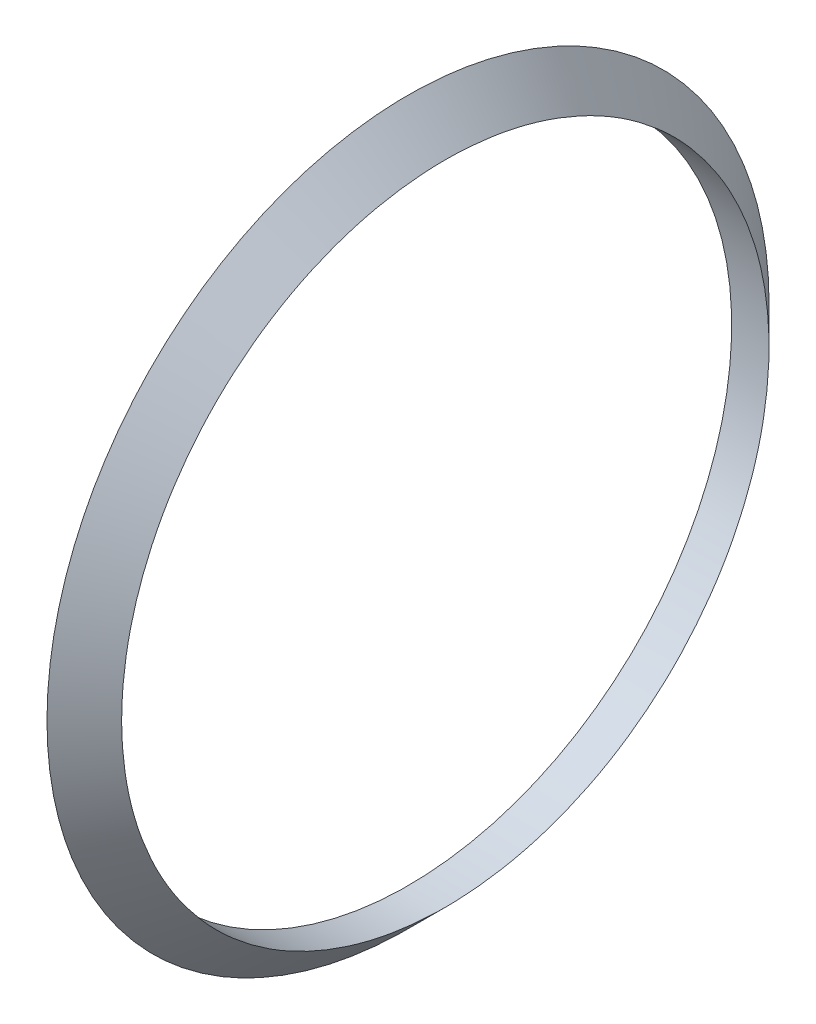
ISO-10303-21;
HEADER;
FILE_DESCRIPTION(('STEP AP214'),'2;1');
FILE_NAME('part.step','',(''),(''),'','','');
FILE_SCHEMA(('AUTOMOTIVE_DESIGN { 1 0 10303 214 1 1 1 1 }'));
ENDSEC;
DATA;
#1=APPLICATION_CONTEXT('core data for automotive mechanical design processes');
#2=APPLICATION_PROTOCOL_DEFINITION('international standard','automotive_design',2000,#1);
#3=PRODUCT_CONTEXT('',#1,'mechanical');
#4=PRODUCT('Part','Part','',(#3));
#5=PRODUCT_RELATED_PRODUCT_CATEGORY('part','',(#4));
#6=PRODUCT_DEFINITION_FORMATION('','',#4);
#7=PRODUCT_DEFINITION_CONTEXT('part definition',#1,'design');
#8=PRODUCT_DEFINITION('design','',#6,#7);
#9=PRODUCT_DEFINITION_SHAPE('','',#8);
#10=(LENGTH_UNIT() NAMED_UNIT(*) SI_UNIT(.MILLI.,.METRE.));
#11=(NAMED_UNIT(*) PLANE_ANGLE_UNIT() SI_UNIT($,.RADIAN.));
#12=(NAMED_UNIT(*) SI_UNIT($,.STERADIAN.) SOLID_ANGLE_UNIT());
#13=UNCERTAINTY_MEASURE_WITH_UNIT(LENGTH_MEASURE(1.E-05),#10,'distance_accuracy_value','');
#14=(GEOMETRIC_REPRESENTATION_CONTEXT(3) GLOBAL_UNCERTAINTY_ASSIGNED_CONTEXT((#13)) GLOBAL_UNIT_ASSIGNED_CONTEXT((#10,
#11,#12)) REPRESENTATION_CONTEXT('',''));
#15=CARTESIAN_POINT('',(0.,0.,0.));
#16=DIRECTION('',(0.,0.,1.));
#17=DIRECTION('',(1.,0.,0.));
#18=AXIS2_PLACEMENT_3D('',#15,#16,#17);
#19=CARTESIAN_POINT('',(15.7003010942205,128.484982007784,0.));
#20=DIRECTION('',(-1.,0.,0.));
#21=DIRECTION('',(0.,0.,1.));
#22=AXIS2_PLACEMENT_3D('',#19,#20,#21);
#23=PLANE('',#22);
#24=CARTESIAN_POINT('',(15.7003010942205,-11.5150179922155,72.5));
#25=CARTESIAN_POINT('',(15.7003010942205,-9.69653230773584,72.4999975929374));
#26=CARTESIAN_POINT('',(15.7003010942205,-7.87789853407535,72.4309373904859));
#27=CARTESIAN_POINT('',(15.7003010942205,-5.15805216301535,72.2254888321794));
#28=CARTESIAN_POINT('',(15.7003010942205,-4.25268559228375,72.1400141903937));
#29=CARTESIAN_POINT('',(15.7003010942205,-2.44573318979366,71.9352549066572));
#30=CARTESIAN_POINT('',(15.7003010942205,-1.54414734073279,71.8159704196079));
#31=CARTESIAN_POINT('',(15.7003010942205,0.254044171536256,71.5436894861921));
#32=CARTESIAN_POINT('',(15.7003010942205,1.15064907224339,71.3906880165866));
#33=CARTESIAN_POINT('',(15.7003010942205,2.93745620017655,71.0509820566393));
#34=CARTESIAN_POINT('',(15.7003010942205,3.82765843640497,70.8642776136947));
#35=CARTESIAN_POINT('',(15.7003010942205,5.60035476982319,70.4573709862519));
#36=CARTESIAN_POINT('',(15.7003010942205,6.48284901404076,70.2371694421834));
#37=CARTESIAN_POINT('',(15.7003010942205,8.23889849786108,69.7636166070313));
#38=CARTESIAN_POINT('',(15.7003010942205,9.11245372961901,69.5102652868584));
#39=CARTESIAN_POINT('',(15.7003010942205,10.8492343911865,68.9708696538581));
#40=CARTESIAN_POINT('',(15.7003010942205,11.712461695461,68.6848313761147));
#41=CARTESIAN_POINT('',(15.7003010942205,13.4275490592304,68.0804960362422));
#42=CARTESIAN_POINT('',(15.7003010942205,14.2794091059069,67.7621989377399));
#43=CARTESIAN_POINT('',(15.7003010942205,15.9705976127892,67.0939126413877));
#44=CARTESIAN_POINT('',(15.7003010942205,16.8099261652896,66.7439236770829));
#45=CARTESIAN_POINT('',(15.7003010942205,18.4748744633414,66.0127275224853));
#46=CARTESIAN_POINT('',(15.7003010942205,19.3004942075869,65.6315203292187));
#47=CARTESIAN_POINT('',(15.7003010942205,20.9369735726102,64.8382404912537));
#48=CARTESIAN_POINT('',(15.7003010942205,21.7478302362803,64.4261617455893));
#49=CARTESIAN_POINT('',(15.7003010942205,23.3534322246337,63.5717298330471));
#50=CARTESIAN_POINT('',(15.7003010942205,24.1481775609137,63.1293766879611));
#51=CARTESIAN_POINT('',(15.7003010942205,25.7204544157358,62.2149591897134));
#52=CARTESIAN_POINT('',(15.7003010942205,26.4979848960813,61.7428930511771));
#53=CARTESIAN_POINT('',(15.7003010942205,28.0346575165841,60.7697089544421));
#54=CARTESIAN_POINT('',(15.7003010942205,28.7937993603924,60.2685905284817));
#55=CARTESIAN_POINT('',(15.7003010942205,30.3823919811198,59.1764169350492));
#56=CARTESIAN_POINT('',(15.7003010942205,31.2093808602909,58.5817766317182));
#57=CARTESIAN_POINT('',(15.7003010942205,32.8377216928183,57.3583394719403));
#58=CARTESIAN_POINT('',(15.7003010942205,33.6390729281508,56.7295416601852));
#59=CARTESIAN_POINT('',(15.7003010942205,35.2147791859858,55.4388836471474));
#60=CARTESIAN_POINT('',(15.7003010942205,35.9891322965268,54.7770211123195));
#61=CARTESIAN_POINT('',(15.7003010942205,37.5093427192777,53.4213132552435));
#62=CARTESIAN_POINT('',(15.7003010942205,38.255200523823,52.7274684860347));
#63=CARTESIAN_POINT('',(15.7003010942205,39.3514860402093,51.6633979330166));
#64=CARTESIAN_POINT('',(15.7003010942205,39.7132245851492,51.30476020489));
#65=CARTESIAN_POINT('',(15.7003010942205,40.4289927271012,50.579872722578));
#66=CARTESIAN_POINT('',(15.7003010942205,40.783022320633,50.2136229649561));
#67=CARTESIAN_POINT('',(15.7003010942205,41.8333772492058,49.1037707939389));
#68=CARTESIAN_POINT('',(15.7003010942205,42.5180023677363,48.3490328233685));
#69=CARTESIAN_POINT('',(15.7003010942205,43.8549162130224,46.8115148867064));
#70=CARTESIAN_POINT('',(15.7003010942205,44.5072055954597,46.0287354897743));
#71=CARTESIAN_POINT('',(15.7003010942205,45.7784188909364,44.436529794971));
#72=CARTESIAN_POINT('',(15.7003010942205,46.3973428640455,43.6271035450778));
#73=CARTESIAN_POINT('',(15.7003010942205,47.6018698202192,41.9813256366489));
#74=CARTESIAN_POINT('',(15.7003010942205,48.1874034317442,41.1449231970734));
#75=CARTESIAN_POINT('',(15.7003010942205,49.3224999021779,39.448064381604));
#76=CARTESIAN_POINT('',(15.7003010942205,49.8720628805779,38.5876080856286));
#77=CARTESIAN_POINT('',(15.7003010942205,50.9341995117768,36.844194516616));
#78=CARTESIAN_POINT('',(15.7003010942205,51.4467751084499,35.9612384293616));
#79=CARTESIAN_POINT('',(15.7003010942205,52.4341045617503,34.1744045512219));
#80=CARTESIAN_POINT('',(15.7003010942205,52.9088540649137,33.270524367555));
#81=CARTESIAN_POINT('',(15.7003010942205,54.2750493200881,30.5301679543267));
#82=CARTESIAN_POINT('',(15.7003010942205,55.1088284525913,28.6643408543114));
#83=CARTESIAN_POINT('',(15.7003010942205,56.2394631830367,25.818848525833));
#84=CARTESIAN_POINT('',(15.7003010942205,56.5963680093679,24.8624527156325));
#85=CARTESIAN_POINT('',(15.7003010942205,57.2695179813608,22.9353541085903));
#86=CARTESIAN_POINT('',(15.7003010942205,57.5857632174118,21.9646513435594));
#87=CARTESIAN_POINT('',(15.7003010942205,58.1763193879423,20.0126331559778));
#88=CARTESIAN_POINT('',(15.7003010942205,58.4507096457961,19.0313416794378));
#89=CARTESIAN_POINT('',(15.7003010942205,58.9577503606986,17.0580307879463));
#90=CARTESIAN_POINT('',(15.7003010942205,59.190401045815,16.0660114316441));
#91=CARTESIAN_POINT('',(15.7003010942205,59.6134990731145,14.0730130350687));
#92=CARTESIAN_POINT('',(15.7003010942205,59.8039462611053,13.0720339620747));
#93=CARTESIAN_POINT('',(15.7003010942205,60.1425562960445,11.0629445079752));
#94=CARTESIAN_POINT('',(15.7003010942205,60.2907188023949,10.0548340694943));
#95=CARTESIAN_POINT('',(15.7003010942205,60.544673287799,8.03327729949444));
#96=CARTESIAN_POINT('',(15.7003010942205,60.6504646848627,7.01983089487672));
#97=CARTESIAN_POINT('',(15.7003010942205,60.8194471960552,4.98939845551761));
#98=CARTESIAN_POINT('',(15.7003010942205,60.8826386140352,3.97241244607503));
#99=CARTESIAN_POINT('',(15.7003010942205,60.9660836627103,1.93667012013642));
#100=CARTESIAN_POINT('',(15.7003010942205,60.9863371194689,0.91791379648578));
#101=CARTESIAN_POINT('',(15.7003010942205,60.9834853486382,-1.11953833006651));
#102=CARTESIAN_POINT('',(15.7003010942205,60.9603801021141,-2.13823413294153));
#103=CARTESIAN_POINT('',(15.7003010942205,60.8712899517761,-4.17318146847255));
#104=CARTESIAN_POINT('',(15.7003010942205,60.8053286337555,-5.18943403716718));
#105=CARTESIAN_POINT('',(15.7003010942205,60.6308681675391,-7.21828650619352));
#106=CARTESIAN_POINT('',(15.7003010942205,60.522368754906,-8.23088638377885));
#107=CARTESIAN_POINT('',(15.7003010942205,60.2630556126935,-10.2506507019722));
#108=CARTESIAN_POINT('',(15.7003010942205,60.1122420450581,-11.2578151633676));
#109=CARTESIAN_POINT('',(15.7003010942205,59.7683731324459,-13.2649026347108));
#110=CARTESIAN_POINT('',(15.7003010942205,59.5753181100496,-14.2648256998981));
#111=CARTESIAN_POINT('',(15.7003010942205,59.1470718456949,-16.2556033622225));
#112=CARTESIAN_POINT('',(15.7003010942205,58.9118809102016,-17.2464580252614));
#113=CARTESIAN_POINT('',(15.7003010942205,58.3998369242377,-19.2173403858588));
#114=CARTESIAN_POINT('',(15.7003010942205,58.1229836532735,-20.197368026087));
#115=CARTESIAN_POINT('',(15.7003010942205,57.5281484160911,-22.1448968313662));
#116=CARTESIAN_POINT('',(15.7003010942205,57.2101661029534,-23.112397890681));
#117=CARTESIAN_POINT('',(15.7003010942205,56.5337858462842,-25.0330633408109));
#118=CARTESIAN_POINT('',(15.7003010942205,56.1753878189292,-25.9862277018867));
#119=CARTESIAN_POINT('',(15.7003010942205,55.0395421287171,-28.8247129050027));
#120=CARTESIAN_POINT('',(15.7003010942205,54.2021706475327,-30.6866459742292));
#121=CARTESIAN_POINT('',(15.7003010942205,52.8309750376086,-33.420909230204));
#122=CARTESIAN_POINT('',(15.7003010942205,52.3546487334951,-34.3226742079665));
#123=CARTESIAN_POINT('',(15.7003010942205,51.3642965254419,-36.1052361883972));
#124=CARTESIAN_POINT('',(15.7003010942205,50.8502749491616,-36.9860355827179));
#125=CARTESIAN_POINT('',(15.7003010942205,49.7853628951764,-38.7251207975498));
#126=CARTESIAN_POINT('',(15.7003010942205,49.2344695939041,-39.5834048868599));
#127=CARTESIAN_POINT('',(15.7003010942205,48.0968541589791,-41.2758996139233));
#128=CARTESIAN_POINT('',(15.7003010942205,47.5101318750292,-42.1101101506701));
#129=CARTESIAN_POINT('',(15.7003010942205,46.3021571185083,-43.753144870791));
#130=CARTESIAN_POINT('',(15.7003010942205,45.6809045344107,-44.5619689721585));
#131=CARTESIAN_POINT('',(15.7003010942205,44.4050307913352,-46.1528469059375));
#132=CARTESIAN_POINT('',(15.7003010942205,43.7504095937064,-46.9349007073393));
#133=CARTESIAN_POINT('',(15.7003010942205,42.4087157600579,-48.470965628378));
#134=CARTESIAN_POINT('',(15.7003010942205,41.7216370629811,-49.2249714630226));
#135=CARTESIAN_POINT('',(15.7003010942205,40.6675894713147,-50.3336123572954));
#136=CARTESIAN_POINT('',(15.7003010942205,40.3123265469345,-50.6994398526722));
#137=CARTESIAN_POINT('',(15.7003010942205,39.5940896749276,-51.4234452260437));
#138=CARTESIAN_POINT('',(15.7003010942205,39.2311157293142,-51.7816231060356));
#139=CARTESIAN_POINT('',(15.7003010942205,38.1309259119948,-52.8444728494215));
#140=CARTESIAN_POINT('',(15.7003010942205,37.3824009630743,-53.5375040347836));
#141=CARTESIAN_POINT('',(15.7003010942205,35.8568668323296,-54.8914337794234));
#142=CARTESIAN_POINT('',(15.7003010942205,35.0798573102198,-55.5523319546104));
#143=CARTESIAN_POINT('',(15.7003010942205,33.498808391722,-56.8409384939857));
#144=CARTESIAN_POINT('',(15.7003010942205,32.6947696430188,-57.468647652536));
#145=CARTESIAN_POINT('',(15.7003010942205,31.0610524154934,-58.6897491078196));
#146=CARTESIAN_POINT('',(15.7003010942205,30.2313741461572,-59.2831416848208));
#147=CARTESIAN_POINT('',(15.7003010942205,28.5476765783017,-60.4343258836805));
#148=CARTESIAN_POINT('',(15.7003010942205,27.6936573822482,-60.9921176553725));
#149=CARTESIAN_POINT('',(15.7003010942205,25.962750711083,-62.0710143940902));
#150=CARTESIAN_POINT('',(15.7003010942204,25.0858632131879,-62.5921193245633));
#151=CARTESIAN_POINT('',(15.7003010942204,23.3119861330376,-63.5961028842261));
#152=CARTESIAN_POINT('',(15.7003010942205,22.4150243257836,-64.0790305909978));
#153=CARTESIAN_POINT('',(15.7003010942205,20.601525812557,-65.0066176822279));
#154=CARTESIAN_POINT('',(15.7003010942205,19.6849890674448,-65.4512769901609));
#155=CARTESIAN_POINT('',(15.7003010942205,17.8340204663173,-66.3016525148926));
#156=CARTESIAN_POINT('',(15.7003010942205,16.8995885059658,-66.7073685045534));
#157=CARTESIAN_POINT('',(15.7003010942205,15.0145324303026,-67.4792576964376));
#158=CARTESIAN_POINT('',(15.7003010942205,14.063908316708,-67.8454309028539));
#159=CARTESIAN_POINT('',(15.7003010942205,12.1480737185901,-68.5374412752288));
#160=CARTESIAN_POINT('',(15.7003010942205,11.1828630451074,-68.8632779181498));
#161=CARTESIAN_POINT('',(15.7003010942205,9.23955190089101,-69.4739256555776));
#162=CARTESIAN_POINT('',(15.7003010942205,8.26145146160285,-69.7587368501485));
#163=CARTESIAN_POINT('',(15.7003010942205,6.29408641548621,-70.2867645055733));
#164=CARTESIAN_POINT('',(15.7003010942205,5.30482181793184,-70.5299810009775));
#165=CARTESIAN_POINT('',(15.7003010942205,3.31688538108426,-70.9743235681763));
#166=CARTESIAN_POINT('',(15.7003010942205,2.31821354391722,-71.1754496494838));
#167=CARTESIAN_POINT('',(15.7003010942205,0.313408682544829,-71.5354030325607));
#168=CARTESIAN_POINT('',(15.7003010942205,-0.692723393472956,-71.6942356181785));
#169=CARTESIAN_POINT('',(15.7003010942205,-2.71076496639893,-71.9696027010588));
#170=CARTESIAN_POINT('',(15.7003010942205,-3.7226745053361,-72.0861368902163));
#171=CARTESIAN_POINT('',(15.7003010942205,-5.75048998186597,-72.2766951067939));
#172=CARTESIAN_POINT('',(15.7003010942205,-6.76639592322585,-72.3507190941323));
#173=CARTESIAN_POINT('',(15.7003010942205,-8.80041517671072,-72.4559770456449));
#174=CARTESIAN_POINT('',(15.7003010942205,-9.818528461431,-72.4872115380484));
#175=CARTESIAN_POINT('',(15.7003010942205,-11.8551784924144,-72.5063873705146));
#176=CARTESIAN_POINT('',(15.7003010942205,-12.8737152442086,-72.4943281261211));
#177=CARTESIAN_POINT('',(15.7003010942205,-14.9093748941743,-72.4271929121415));
#178=CARTESIAN_POINT('',(15.7003010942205,-15.9264977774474,-72.3721164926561));
#179=CARTESIAN_POINT('',(15.7003010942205,-17.9575351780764,-72.2193472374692));
#180=CARTESIAN_POINT('',(15.7003010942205,-18.9714496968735,-72.1216544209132));
#181=CARTESIAN_POINT('',(15.7003010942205,-20.9942939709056,-71.8838849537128));
#182=CARTESIAN_POINT('',(15.7003010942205,-22.0032237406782,-71.7438084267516));
#183=CARTESIAN_POINT('',(15.7003010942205,-24.0166901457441,-71.4210182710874));
#184=CARTESIAN_POINT('',(15.7003010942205,-25.0212107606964,-71.2382046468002));
#185=CARTESIAN_POINT('',(15.7003010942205,-27.0215971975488,-70.830150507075));
#186=CARTESIAN_POINT('',(15.7003010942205,-28.0174630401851,-70.6049100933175));
#187=CARTESIAN_POINT('',(15.7003010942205,-29.9987526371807,-70.1124223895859));
#188=CARTESIAN_POINT('',(15.7003010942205,-30.9841763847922,-69.8451750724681));
#189=CARTESIAN_POINT('',(15.7003010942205,-32.9428281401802,-69.2692053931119));
#190=CARTESIAN_POINT('',(15.7003010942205,-33.916056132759,-68.960482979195));
#191=CARTESIAN_POINT('',(15.7003010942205,-35.8485774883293,-68.3022065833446));
#192=CARTESIAN_POINT('',(15.7003010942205,-36.807871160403,-67.9526535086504));
#193=CARTESIAN_POINT('',(15.7003010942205,-38.7108975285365,-67.213486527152));
#194=CARTESIAN_POINT('',(15.7003010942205,-39.6546302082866,-66.8238725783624));
#195=CARTESIAN_POINT('',(15.7003010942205,-41.5248636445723,-66.0052845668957));
#196=CARTESIAN_POINT('',(15.7003010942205,-42.4513644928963,-65.5763107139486));
#197=CARTESIAN_POINT('',(15.7003010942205,-44.2854197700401,-64.6796112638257));
#198=CARTESIAN_POINT('',(15.7003010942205,-45.1929742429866,-64.2118857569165));
#199=CARTESIAN_POINT('',(15.7003010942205,-46.985543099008,-63.2394869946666));
#200=CARTESIAN_POINT('',(15.7003010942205,-47.8706017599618,-62.7348953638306));
#201=CARTESIAN_POINT('',(15.7003010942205,-49.6186883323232,-61.6886760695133));
#202=CARTESIAN_POINT('',(15.7003010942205,-50.4817137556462,-61.1470442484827));
#203=CARTESIAN_POINT('',(15.7003010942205,-52.1840710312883,-60.0277416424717));
#204=CARTESIAN_POINT('',(15.7003010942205,-53.0234027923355,-59.4500707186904));
#205=CARTESIAN_POINT('',(15.7003010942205,-54.6769481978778,-58.2600268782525));
#206=CARTESIAN_POINT('',(15.7003010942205,-55.4911646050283,-57.6476577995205));
#207=CARTESIAN_POINT('',(15.7003010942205,-57.0932805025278,-56.3893046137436));
#208=CARTESIAN_POINT('',(15.7003010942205,-57.8811782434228,-55.7433182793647));
#209=CARTESIAN_POINT('',(15.7003010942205,-59.4291754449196,-54.4188656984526));
#210=CARTESIAN_POINT('',(15.7003010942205,-60.1892751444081,-53.7403997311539));
#211=CARTESIAN_POINT('',(15.7003010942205,-61.6801568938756,-52.3519718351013));
#212=CARTESIAN_POINT('',(15.7003010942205,-62.4109388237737,-51.6420097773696));
#213=CARTESIAN_POINT('',(15.7003010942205,-63.8416537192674,-50.1916529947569));
#214=CARTESIAN_POINT('',(15.7003010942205,-64.5415866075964,-49.4512581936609));
#215=CARTESIAN_POINT('',(15.7003010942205,-65.9093797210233,-47.9419903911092));
#216=CARTESIAN_POINT('',(15.7003010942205,-66.577253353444,-47.1731295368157));
#217=CARTESIAN_POINT('',(15.7003010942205,-67.8801964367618,-45.6080922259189));
#218=CARTESIAN_POINT('',(15.7003010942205,-68.5152657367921,-44.8119156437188));
#219=CARTESIAN_POINT('',(15.7003010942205,-69.7514926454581,-43.1936596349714));
#220=CARTESIAN_POINT('',(15.7003010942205,-70.3526503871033,-42.3715803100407));
#221=CARTESIAN_POINT('',(15.7003010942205,-71.5198045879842,-40.7028330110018));
#222=CARTESIAN_POINT('',(15.7003010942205,-72.0858012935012,-39.8561652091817));
#223=CARTESIAN_POINT('',(15.7003010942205,-73.1814560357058,-38.139644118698));
#224=CARTESIAN_POINT('',(15.7003010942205,-73.7111143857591,-37.2697910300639));
#225=CARTESIAN_POINT('',(15.7003010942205,-74.733203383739,-35.5084769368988));
#226=CARTESIAN_POINT('',(15.7003010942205,-75.2256338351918,-34.6170158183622));
#227=CARTESIAN_POINT('',(15.7003010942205,-76.1724443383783,-32.8141014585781));
#228=CARTESIAN_POINT('',(15.7003010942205,-76.6268240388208,-31.9026480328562));
#229=CARTESIAN_POINT('',(15.7003010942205,-77.4968144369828,-30.0614232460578));
#230=CARTESIAN_POINT('',(15.7003010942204,-77.912425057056,-29.1316518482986));
#231=CARTESIAN_POINT('',(15.7003010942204,-78.7048782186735,-27.2541244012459));
#232=CARTESIAN_POINT('',(15.7003010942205,-79.0816629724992,-26.3063439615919));
#233=CARTESIAN_POINT('',(15.7003010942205,-79.7949963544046,-24.3957608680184));
#234=CARTESIAN_POINT('',(15.7003010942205,-80.1315450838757,-23.4329582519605));
#235=CARTESIAN_POINT('',(15.7003010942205,-80.7636974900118,-21.4939522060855));
#236=CARTESIAN_POINT('',(15.7003010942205,-81.0592992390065,-20.5177481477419));
#237=CARTESIAN_POINT('',(15.7003010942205,-81.6089074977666,-18.5538199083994));
#238=CARTESIAN_POINT('',(15.7003010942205,-81.8629187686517,-17.5660970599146));
#239=CARTESIAN_POINT('',(15.7003010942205,-82.3288911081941,-15.5807018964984));
#240=CARTESIAN_POINT('',(15.7003010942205,-82.5408489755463,-14.583028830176));
#241=CARTESIAN_POINT('',(15.7003010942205,-82.9223901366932,-12.5796114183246));
#242=CARTESIAN_POINT('',(15.7003010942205,-83.0919732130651,-11.5738670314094));
#243=CARTESIAN_POINT('',(15.7003010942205,-83.3887576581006,-9.5561416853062));
#244=CARTESIAN_POINT('',(15.7003010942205,-83.5159588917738,-8.54416070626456));
#245=CARTESIAN_POINT('',(15.7003010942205,-83.7278018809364,-6.51576282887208));
#246=CARTESIAN_POINT('',(15.7003010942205,-83.8124436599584,-5.49934593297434));
#247=CARTESIAN_POINT('',(15.7003010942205,-83.9389001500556,-3.46370861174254));
#248=CARTESIAN_POINT('',(15.7003010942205,-83.9807104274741,-2.44448790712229));
#249=CARTESIAN_POINT('',(15.7003010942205,-84.0109948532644,-0.915080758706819));
#250=CARTESIAN_POINT('',(15.7003010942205,-84.015684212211,-0.405169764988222));
#251=CARTESIAN_POINT('',(15.7003010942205,-84.0141990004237,0.614636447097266));
#252=CARTESIAN_POINT('',(15.7003010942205,-84.0080244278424,1.12453166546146));
#253=CARTESIAN_POINT('',(15.7003010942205,-83.9732981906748,2.65383451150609));
#254=CARTESIAN_POINT('',(15.7003010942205,-83.9285451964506,3.67291986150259));
#255=CARTESIAN_POINT('',(15.7003010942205,-83.7962179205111,5.70828110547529));
#256=CARTESIAN_POINT('',(15.7003010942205,-83.7086431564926,6.72455696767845));
#257=CARTESIAN_POINT('',(15.7003010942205,-83.4909435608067,8.75252616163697));
#258=CARTESIAN_POINT('',(15.7003010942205,-83.360819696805,9.76421959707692));
#259=CARTESIAN_POINT('',(15.7003010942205,-83.0581895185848,11.7812395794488));
#260=CARTESIAN_POINT('',(15.7003010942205,-82.8856835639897,12.7865661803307));
#261=CARTESIAN_POINT('',(15.7003010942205,-82.4982941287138,14.7890205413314));
#262=CARTESIAN_POINT('',(15.7003010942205,-82.2834108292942,15.7861483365));
#263=CARTESIAN_POINT('',(15.7003010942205,-81.8115972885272,17.7704070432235));
#264=CARTESIAN_POINT('',(15.7003010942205,-81.554666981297,18.7575379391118));
#265=CARTESIAN_POINT('',(15.7003010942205,-80.9996585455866,20.7186970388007));
#266=CARTESIAN_POINT('',(15.7003010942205,-80.7016374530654,21.6927413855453));
#267=CARTESIAN_POINT('',(15.7003010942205,-80.0647843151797,23.6273963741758));
#268=CARTESIAN_POINT('',(15.7003010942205,-79.7259521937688,24.588006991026));
#269=CARTESIAN_POINT('',(15.7003010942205,-79.0082088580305,26.4941395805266));
#270=CARTESIAN_POINT('',(15.7003010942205,-78.6292974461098,27.4396614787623));
#271=CARTESIAN_POINT('',(15.7003010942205,-77.8321511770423,29.3139815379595));
#272=CARTESIAN_POINT('',(15.7003010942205,-77.4139163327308,30.2427797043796));
#273=CARTESIAN_POINT('',(15.7003010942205,-76.5387041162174,32.0819431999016));
#274=CARTESIAN_POINT('',(15.7003010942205,-76.0817267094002,32.9923085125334));
#275=CARTESIAN_POINT('',(15.7003010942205,-75.129753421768,34.7929387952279));
#276=CARTESIAN_POINT('',(15.7003010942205,-74.6347575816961,35.68320378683));
#277=CARTESIAN_POINT('',(15.7003010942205,-73.6075785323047,37.4420162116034));
#278=CARTESIAN_POINT('',(15.7003010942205,-73.0753953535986,38.3105636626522));
#279=CARTESIAN_POINT('',(15.7003010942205,-71.9747458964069,40.0243558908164));
#280=CARTESIAN_POINT('',(15.7003010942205,-71.4062795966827,40.8696006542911));
#281=CARTESIAN_POINT('',(15.7003010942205,-70.2342759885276,42.5353858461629));
#282=CARTESIAN_POINT('',(15.7003010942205,-69.6307393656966,43.3559267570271));
#283=CARTESIAN_POINT('',(15.7003010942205,-68.3898175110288,44.971008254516));
#284=CARTESIAN_POINT('',(15.7003010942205,-67.7524320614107,45.765548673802));
#285=CARTESIAN_POINT('',(15.7003010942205,-66.4449131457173,47.3272160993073));
#286=CARTESIAN_POINT('',(15.7003010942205,-65.77477958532,48.0943430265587));
#287=CARTESIAN_POINT('',(15.7003010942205,-64.4028155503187,49.5996999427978));
#288=CARTESIAN_POINT('',(15.7003010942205,-63.7009854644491,50.3379302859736));
#289=CARTESIAN_POINT('',(15.7003010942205,-62.2664922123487,51.7839573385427));
#290=CARTESIAN_POINT('',(15.7003010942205,-61.5338257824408,52.4917508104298));
#291=CARTESIAN_POINT('',(15.7003010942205,-60.0392832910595,53.875804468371));
#292=CARTESIAN_POINT('',(15.7003010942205,-59.2774068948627,54.5520642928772));
#293=CARTESIAN_POINT('',(15.7003010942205,-57.7259705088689,55.8720309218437));
#294=CARTESIAN_POINT('',(15.7003010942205,-56.9364107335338,56.5157379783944));
#295=CARTESIAN_POINT('',(15.7003010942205,-55.3310217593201,57.7695088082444));
#296=CARTESIAN_POINT('',(15.7003010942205,-54.5151926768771,58.3795727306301));
#297=CARTESIAN_POINT('',(15.7003010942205,-52.8565145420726,59.5663543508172));
#298=CARTESIAN_POINT('',(15.7003010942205,-52.013602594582,60.142984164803));
#299=CARTESIAN_POINT('',(15.7003010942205,-50.3040733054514,61.2599642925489));
#300=CARTESIAN_POINT('',(15.7003010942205,-49.4374559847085,61.800314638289));
#301=CARTESIAN_POINT('',(15.7003010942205,-47.6820690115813,62.8438122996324));
#302=CARTESIAN_POINT('',(15.7003010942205,-46.7932986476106,63.3469584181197));
#303=CARTESIAN_POINT('',(15.7003010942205,-44.9952541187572,64.3151742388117));
#304=CARTESIAN_POINT('',(15.7003010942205,-44.0859799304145,64.7802438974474));
#305=CARTESIAN_POINT('',(15.7003010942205,-42.2490067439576,65.6713578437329));
#306=CARTESIAN_POINT('',(15.7003010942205,-41.3213161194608,66.0974193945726));
#307=CARTESIAN_POINT('',(15.7003010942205,-39.4488337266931,66.9101527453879));
#308=CARTESIAN_POINT('',(15.7003010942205,-38.5040418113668,67.2968242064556));
#309=CARTESIAN_POINT('',(15.7003010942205,-36.599115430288,68.0300171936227));
#310=CARTESIAN_POINT('',(15.7003010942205,-35.6389827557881,68.3765433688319));
#311=CARTESIAN_POINT('',(15.7003010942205,-33.7050139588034,69.0287083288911));
#312=CARTESIAN_POINT('',(15.7003010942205,-32.7311782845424,69.3343484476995));
#313=CARTESIAN_POINT('',(15.7003010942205,-30.1100093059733,70.0964298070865));
#314=CARTESIAN_POINT('',(15.7003010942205,-28.4516279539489,70.5154621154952));
#315=CARTESIAN_POINT('',(15.7003010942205,-25.1095979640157,71.2346484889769));
#316=CARTESIAN_POINT('',(15.7003010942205,-23.425951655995,71.5348134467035));
#317=CARTESIAN_POINT('',(15.7003010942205,-20.0420490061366,72.0159779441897));
#318=CARTESIAN_POINT('',(15.7003010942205,-18.3417962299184,72.1970025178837));
#319=CARTESIAN_POINT('',(15.7003010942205,-14.9327454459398,72.4390169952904));
#320=CARTESIAN_POINT('',(15.7003010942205,-13.2239471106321,72.5000022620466));
#321=CARTESIAN_POINT('',(15.7003010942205,-11.5150179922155,72.5));
#322=B_SPLINE_CURVE_WITH_KNOTS('',3,(#24,#25,#26,#27,#28,#29,#30,#31,#32,#33,#34,#35,#36,#37,
#38,#39,#40,#41,#42,#43,#44,#45,#46,#47,#48,#49,#50,#51,#52,#53,#54,#55,#56,#57,#58,#59,#60,#61,
#62,#63,#64,#65,#66,#67,#68,#69,#70,#71,#72,#73,#74,#75,#76,#77,#78,#79,#80,#81,#82,#83,#84,#85,
#86,#87,#88,#89,#90,#91,#92,#93,#94,#95,#96,#97,#98,#99,#100,#101,#102,#103,#104,#105,#106,#107,
#108,#109,#110,#111,#112,#113,#114,#115,#116,#117,#118,#119,#120,#121,#122,#123,#124,#125,#126,
#127,#128,#129,#130,#131,#132,#133,#134,#135,#136,#137,#138,#139,#140,#141,#142,#143,#144,#145,
#146,#147,#148,#149,#150,#151,#152,#153,#154,#155,#156,#157,#158,#159,#160,#161,#162,#163,#164,
#165,#166,#167,#168,#169,#170,#171,#172,#173,#174,#175,#176,#177,#178,#179,#180,#181,#182,#183,
#184,#185,#186,#187,#188,#189,#190,#191,#192,#193,#194,#195,#196,#197,#198,#199,#200,#201,#202,
#203,#204,#205,#206,#207,#208,#209,#210,#211,#212,#213,#214,#215,#216,#217,#218,#219,#220,#221,
#222,#223,#224,#225,#226,#227,#228,#229,#230,#231,#232,#233,#234,#235,#236,#237,#238,#239,#240,
#241,#242,#243,#244,#245,#246,#247,#248,#249,#250,#251,#252,#253,#254,#255,#256,#257,#258,#259,
#260,#261,#262,#263,#264,#265,#266,#267,#268,#269,#270,#271,#272,#273,#274,#275,#276,#277,#278,
#279,#280,#281,#282,#283,#284,#285,#286,#287,#288,#289,#290,#291,#292,#293,#294,#295,#296,#297,
#298,#299,#300,#301,#302,#303,#304,#305,#306,#307,#308,#309,#310,#311,#312,#313,#314,#315,#316,
#317,#318,#319,#320,#321),.UNSPECIFIED.,.T.,.F.,(4,2,2,2,2,2,2,2,2,2,2,2,2,2,2,2,2,2,2,2,2,2,2,
2,2,2,2,2,2,2,2,2,2,2,2,2,2,2,2,2,2,2,2,2,2,2,2,2,2,2,2,2,2,2,2,2,2,2,2,2,2,2,2,2,2,2,2,2,2,2,2,
2,2,2,2,2,2,2,2,2,2,2,2,2,2,2,2,2,2,2,2,2,2,2,2,2,2,2,2,2,2,2,2,2,2,2,2,2,2,2,2,2,2,2,2,2,2,2,2,
2,2,2,2,2,2,2,2,2,2,2,2,2,2,2,2,2,2,2,2,2,2,2,2,2,2,2,2,2,4),(0.,5.45410611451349,
8.18177557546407,10.9094325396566,13.6374961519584,16.3655559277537,19.0935635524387,
21.8215735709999,24.5490807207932,27.2765909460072,30.0040810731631,32.7315714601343,
35.4596022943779,38.1876311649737,40.9158241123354,43.6440609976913,46.6988880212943,
49.7538005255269,52.8089289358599,55.8640045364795,57.3920676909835,58.920131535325,
61.9761186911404,65.0320438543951,68.0879635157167,71.1500166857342,74.2120596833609,
77.2739416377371,80.3361754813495,86.4584195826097,89.5202068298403,92.5819872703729,
95.6378909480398,98.6937779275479,101.749676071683,104.805598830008,107.861563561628,
110.91750649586,113.973461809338,117.029418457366,120.083694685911,123.137989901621,
126.192273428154,129.246533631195,132.300771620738,135.355025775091,138.409305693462,
141.46359194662,147.579608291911,150.638434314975,153.696909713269,156.755619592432,
159.814342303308,162.873074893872,165.931811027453,168.991120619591,170.520848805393,
172.050576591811,175.109853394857,178.169166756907,181.228406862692,184.287621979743,
187.346824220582,190.406029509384,193.461235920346,196.516448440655,199.571678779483,
202.626908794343,205.682178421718,208.737440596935,211.792700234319,214.847959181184,
217.902836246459,220.957735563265,224.012637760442,227.067502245,230.122407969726,
233.177345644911,236.232281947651,239.287209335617,242.349357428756,245.411498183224,
248.473640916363,251.535787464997,254.597865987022,257.659947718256,260.722013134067,
263.784071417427,266.83954432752,269.895360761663,272.951188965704,276.006679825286,
279.062373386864,282.118040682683,285.173720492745,288.22940795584,291.28380618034,
294.338218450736,297.392618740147,300.446997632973,303.501350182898,306.555718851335,
309.61011571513,312.664518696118,315.723404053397,318.782281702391,321.841303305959,
324.899974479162,327.958878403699,331.017798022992,334.076727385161,337.135655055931,
340.194899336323,341.724597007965,343.254294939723,346.313509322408,349.372758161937,
352.431937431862,355.491090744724,358.550230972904,361.609375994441,364.664316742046,
367.719263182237,370.774224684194,373.829185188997,376.884148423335,379.939108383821,
382.994065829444,386.049025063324,389.103924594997,392.158843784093,395.213771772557,
398.268662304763,401.323876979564,404.379126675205,407.434352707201,410.489565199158,
413.552474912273,416.615381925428,419.678387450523,422.741396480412,425.80304334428,
428.864716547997,431.926034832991,434.987253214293,440.114120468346,445.240517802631,
450.365837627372,455.491355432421),.UNSPECIFIED.);
#323=CARTESIAN_POINT('',(15.7003010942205,-11.5150179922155,72.5));
#324=VERTEX_POINT('',#323);
#325=EDGE_CURVE('E62',#324,#324,#322,.T.);
#326=ORIENTED_EDGE('',*,*,#325,.T.);
#327=EDGE_LOOP('',(#326));
#328=FACE_BOUND('',#327,.T.);
#329=CARTESIAN_POINT('',(15.7003010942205,-11.5150179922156,0.));
#330=DIRECTION('',(-1.,0.,0.));
#331=DIRECTION('',(0.,0.,1.));
#332=AXIS2_PLACEMENT_3D('',#329,#330,#331);
#333=CIRCLE('',#332,65.);
#334=CARTESIAN_POINT('',(15.7003010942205,-11.5150179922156,65.));
#335=VERTEX_POINT('',#334);
#336=EDGE_CURVE('E72',#335,#335,#333,.T.);
#337=ORIENTED_EDGE('',*,*,#336,.F.);
#338=EDGE_LOOP('',(#337));
#339=FACE_BOUND('',#338,.T.);
#340=ADVANCED_FACE('F55',(#328,#339),#23,.T.);
#341=CARTESIAN_POINT('',(-52.2996989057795,-11.5150179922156,0.));
#342=DIRECTION('',(-1.,0.,0.));
#343=DIRECTION('',(0.,0.,1.));
#344=AXIS2_PLACEMENT_3D('',#341,#342,#343);
#345=CYLINDRICAL_SURFACE('',#344,65.);
#346=CARTESIAN_POINT('',(23.2003010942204,-11.5150179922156,64.9999999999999));
#347=CARTESIAN_POINT('',(23.2003010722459,-12.7187458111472,64.9999995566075));
#348=CARTESIAN_POINT('',(23.1999911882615,-13.9224809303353,64.9665526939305));
#349=CARTESIAN_POINT('',(23.199511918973,-16.3265169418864,64.8328563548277));
#350=CARTESIAN_POINT('',(23.1993425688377,-17.5268168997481,64.7325901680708));
#351=CARTESIAN_POINT('',(23.1994122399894,-19.9201401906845,64.4655227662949));
#352=CARTESIAN_POINT('',(23.1996512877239,-21.1131630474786,64.2987172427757));
#353=CARTESIAN_POINT('',(23.2001206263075,-22.8948351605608,63.9989306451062));
#354=CARTESIAN_POINT('',(23.2002956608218,-23.4877403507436,63.8906653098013));
#355=CARTESIAN_POINT('',(23.2005877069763,-24.6703134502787,63.6576891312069));
#356=CARTESIAN_POINT('',(23.2007047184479,-25.2599813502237,63.5329782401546));
#357=CARTESIAN_POINT('',(23.2009525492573,-27.0233418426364,63.1343338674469));
#358=CARTESIAN_POINT('',(23.2009802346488,-28.1915795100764,62.8358569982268));
#359=CARTESIAN_POINT('',(23.2008445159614,-30.5095979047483,62.1744212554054));
#360=CARTESIAN_POINT('',(23.2006811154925,-31.6593789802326,61.8114636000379));
#361=CARTESIAN_POINT('',(23.2003874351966,-33.6518552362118,61.1210023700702));
#362=CARTESIAN_POINT('',(23.2002591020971,-34.4993813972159,60.8073632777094));
#363=CARTESIAN_POINT('',(23.2001470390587,-36.1806892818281,60.1450000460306));
#364=CARTESIAN_POINT('',(23.2001633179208,-37.0144701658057,59.7962737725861));
#365=CARTESIAN_POINT('',(23.2003146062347,-38.666755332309,59.0643683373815));
#366=CARTESIAN_POINT('',(23.2004496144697,-39.4852597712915,58.6811895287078));
#367=CARTESIAN_POINT('',(23.2006996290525,-41.1055702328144,57.881047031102));
#368=CARTESIAN_POINT('',(23.2008146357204,-41.9073765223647,57.464083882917));
#369=CARTESIAN_POINT('',(23.2009494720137,-43.4927076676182,56.5972026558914));
#370=CARTESIAN_POINT('',(23.2009693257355,-44.2762371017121,56.147292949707));
#371=CARTESIAN_POINT('',(23.2008680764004,-45.8239503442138,55.2151548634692));
#372=CARTESIAN_POINT('',(23.2007469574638,-46.5881319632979,54.7329228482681));
#373=CARTESIAN_POINT('',(23.2003499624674,-48.0957328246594,53.7370214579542));
#374=CARTESIAN_POINT('',(23.2000740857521,-48.8391519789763,53.2233519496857));
#375=CARTESIAN_POINT('',(23.1996293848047,-50.3038496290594,52.1655301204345));
#376=CARTESIAN_POINT('',(23.1994605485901,-51.0251305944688,51.6213812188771));
#377=CARTESIAN_POINT('',(23.1993375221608,-52.4525175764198,50.4970882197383));
#378=CARTESIAN_POINT('',(23.1993858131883,-53.1583550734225,49.9166031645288));
#379=CARTESIAN_POINT('',(23.1996511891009,-54.5449321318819,48.7263921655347));
#380=CARTESIAN_POINT('',(23.1998682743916,-55.2256716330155,48.1166661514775));
#381=CARTESIAN_POINT('',(23.200207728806,-56.560846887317,46.8690528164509));
#382=CARTESIAN_POINT('',(23.2003300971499,-57.2152824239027,46.2311652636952));
#383=CARTESIAN_POINT('',(23.2002313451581,-58.4966793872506,44.9283686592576));
#384=CARTESIAN_POINT('',(23.2000102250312,-59.1236408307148,44.2634596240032));
#385=CARTESIAN_POINT('',(23.1996271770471,-60.3490144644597,42.9077579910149));
#386=CARTESIAN_POINT('',(23.1994652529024,-60.9474248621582,42.2169637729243));
#387=CARTESIAN_POINT('',(23.1993402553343,-62.1145877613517,40.810764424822));
#388=CARTESIAN_POINT('',(23.1993771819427,-62.6833402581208,40.0953592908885));
#389=CARTESIAN_POINT('',(23.1996590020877,-63.7901842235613,38.6411931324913));
#390=CARTESIAN_POINT('',(23.1999038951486,-64.3282757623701,37.9024321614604));
#391=CARTESIAN_POINT('',(23.2003811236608,-65.3728063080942,36.4029372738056));
#392=CARTESIAN_POINT('',(23.2006134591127,-65.8792453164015,35.6422033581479));
#393=CARTESIAN_POINT('',(23.2010459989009,-67.3496888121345,33.3290615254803));
#394=CARTESIAN_POINT('',(23.2009819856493,-68.2650980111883,31.7453478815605));
#395=CARTESIAN_POINT('',(23.2005523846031,-69.9591186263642,28.5066292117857));
#396=CARTESIAN_POINT('',(23.2001867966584,-70.737729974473,26.8516241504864));
#397=CARTESIAN_POINT('',(23.2001424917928,-72.152781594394,23.4819272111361));
#398=CARTESIAN_POINT('',(23.2004637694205,-72.7892229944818,21.7672358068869));
#399=CARTESIAN_POINT('',(23.2009178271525,-73.9154253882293,18.2901012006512));
#400=CARTESIAN_POINT('',(23.2010506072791,-74.4051863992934,16.5276580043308));
#401=CARTESIAN_POINT('',(23.200734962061,-75.0271043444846,13.8582360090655));
#402=CARTESIAN_POINT('',(23.2005438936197,-75.2156380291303,12.9640330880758));
#403=CARTESIAN_POINT('',(23.2000811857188,-75.5548573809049,11.1684144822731));
#404=CARTESIAN_POINT('',(23.199809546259,-75.7055430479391,10.2669987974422));
#405=CARTESIAN_POINT('',(23.1994475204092,-75.9687731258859,8.4586300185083));
#406=CARTESIAN_POINT('',(23.1993571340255,-76.0813175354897,7.55167692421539));
#407=CARTESIAN_POINT('',(23.1993923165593,-76.2680717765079,5.73383604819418));
#408=CARTESIAN_POINT('',(23.1995178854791,-76.3422816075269,4.82294826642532));
#409=CARTESIAN_POINT('',(23.1998674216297,-76.4522327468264,2.99882604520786));
#410=CARTESIAN_POINT('',(23.2000913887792,-76.4879740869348,2.08559160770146));
#411=CARTESIAN_POINT('',(23.2002741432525,-76.5126883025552,0.715276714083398));
#412=CARTESIAN_POINT('',(23.2003095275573,-76.5161097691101,0.258415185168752));
#413=CARTESIAN_POINT('',(23.2002868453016,-76.5133204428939,-0.655278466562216));
#414=CARTESIAN_POINT('',(23.2002287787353,-76.5071096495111,-1.11211058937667));
#415=CARTESIAN_POINT('',(23.200001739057,-76.4740293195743,-2.482249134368));
#416=CARTESIAN_POINT('',(23.1997799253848,-76.4327127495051,-3.3952485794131));
#417=CARTESIAN_POINT('',(23.1994597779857,-76.311626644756,-5.21866405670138));
#418=CARTESIAN_POINT('',(23.1993614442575,-76.2318571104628,-6.12908008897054));
#419=CARTESIAN_POINT('',(23.199386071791,-76.0340067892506,-7.9457479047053));
#420=CARTESIAN_POINT('',(23.1995090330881,-75.9159259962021,-8.85199968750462));
#421=CARTESIAN_POINT('',(23.1999126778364,-75.6416631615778,-10.6587172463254));
#422=CARTESIAN_POINT('',(23.2001933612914,-75.4854811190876,-11.5591830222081));
#423=CARTESIAN_POINT('',(23.200635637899,-75.1352934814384,-13.3527301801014));
#424=CARTESIAN_POINT('',(23.2007972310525,-74.9412878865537,-14.2458115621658));
#425=CARTESIAN_POINT('',(23.2009621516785,-74.5157981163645,-16.0230011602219));
#426=CARTESIAN_POINT('',(23.2009654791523,-74.2843139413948,-16.907109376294));
#427=CARTESIAN_POINT('',(23.2008650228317,-73.7842783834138,-18.6647816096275));
#428=CARTESIAN_POINT('',(23.2007612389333,-73.5157269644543,-19.5383456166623));
#429=CARTESIAN_POINT('',(23.2005172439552,-72.9420346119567,-21.2733751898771));
#430=CARTESIAN_POINT('',(23.2003770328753,-72.6368936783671,-22.1348407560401));
#431=CARTESIAN_POINT('',(23.2001895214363,-71.9905648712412,-23.8441416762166));
#432=CARTESIAN_POINT('',(23.2001422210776,-71.649376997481,-24.6919770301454));
#433=CARTESIAN_POINT('',(23.2002147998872,-70.9315609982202,-26.3725099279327));
#434=CARTESIAN_POINT('',(23.2003346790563,-70.554932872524,-27.2052074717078));
#435=CARTESIAN_POINT('',(23.200585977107,-69.7669061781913,-28.853983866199));
#436=CARTESIAN_POINT('',(23.2007173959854,-69.3555076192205,-29.670062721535));
#437=CARTESIAN_POINT('',(23.2009028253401,-68.4986714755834,-31.2841509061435));
#438=CARTESIAN_POINT('',(23.2009568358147,-68.0532338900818,-32.0821602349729));
#439=CARTESIAN_POINT('',(23.2009349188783,-67.1291117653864,-33.6586903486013));
#440=CARTESIAN_POINT('',(23.20085899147,-66.650427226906,-34.4372111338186));
#441=CARTESIAN_POINT('',(23.2005283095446,-65.6606623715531,-35.9733798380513));
#442=CARTESIAN_POINT('',(23.2002735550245,-65.1495820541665,-36.7310277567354));
#443=CARTESIAN_POINT('',(23.1997977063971,-64.0959346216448,-38.2241032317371));
#444=CARTESIAN_POINT('',(23.1995766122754,-63.5533675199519,-38.9595307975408));
#445=CARTESIAN_POINT('',(23.1993508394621,-62.4377110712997,-40.4068582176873));
#446=CARTESIAN_POINT('',(23.1993461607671,-61.8646217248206,-41.1187580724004));
#447=CARTESIAN_POINT('',(23.1995258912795,-60.6889398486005,-42.5177641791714));
#448=CARTESIAN_POINT('',(23.1997103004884,-60.0863473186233,-43.2048704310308));
#449=CARTESIAN_POINT('',(23.2000905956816,-58.8527305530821,-44.553067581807));
#450=CARTESIAN_POINT('',(23.2002864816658,-58.2217063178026,-45.2141584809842));
#451=CARTESIAN_POINT('',(23.2003127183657,-56.9323483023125,-46.5091493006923));
#452=CARTESIAN_POINT('',(23.2001430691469,-56.2740145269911,-47.1430492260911));
#453=CARTESIAN_POINT('',(23.1997742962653,-54.9312076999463,-48.3825312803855));
#454=CARTESIAN_POINT('',(23.1995751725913,-54.2467346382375,-48.9881133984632));
#455=CARTESIAN_POINT('',(23.1993582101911,-52.8528666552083,-50.1698826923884));
#456=CARTESIAN_POINT('',(23.19934037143,-52.1434717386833,-50.7460698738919));
#457=CARTESIAN_POINT('',(23.1995243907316,-50.7010213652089,-51.8680248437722));
#458=CARTESIAN_POINT('',(23.1997262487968,-49.9679659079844,-52.4137926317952));
#459=CARTESIAN_POINT('',(23.200195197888,-48.4794978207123,-53.4739384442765));
#460=CARTESIAN_POINT('',(23.2004622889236,-47.7240851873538,-53.9883164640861));
#461=CARTESIAN_POINT('',(23.2008219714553,-46.1922460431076,-54.9847680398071));
#462=CARTESIAN_POINT('',(23.200914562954,-45.4158195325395,-55.46684159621));
#463=CARTESIAN_POINT('',(23.2009648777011,-43.8433332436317,-56.3978270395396));
#464=CARTESIAN_POINT('',(23.2009226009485,-43.0472734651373,-56.8467389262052));
#465=CARTESIAN_POINT('',(23.2007532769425,-41.4369361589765,-57.7106027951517));
#466=CARTESIAN_POINT('',(23.2006262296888,-40.6226586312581,-58.1255547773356));
#467=CARTESIAN_POINT('',(23.2003716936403,-38.9773337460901,-58.9207609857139));
#468=CARTESIAN_POINT('',(23.2002442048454,-38.1462863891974,-59.3010152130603));
#469=CARTESIAN_POINT('',(23.2001440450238,-36.4688995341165,-60.0261497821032));
#470=CARTESIAN_POINT('',(23.2001713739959,-35.6225600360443,-60.371030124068));
#471=CARTESIAN_POINT('',(23.2003374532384,-33.9160938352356,-61.0248036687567));
#472=CARTESIAN_POINT('',(23.2004762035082,-33.0559671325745,-61.3336968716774));
#473=CARTESIAN_POINT('',(23.2007262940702,-31.3234559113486,-61.9149468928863));
#474=CARTESIAN_POINT('',(23.2008376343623,-30.4510713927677,-62.187303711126));
#475=CARTESIAN_POINT('',(23.2009585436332,-28.6955956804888,-62.6949967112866));
#476=CARTESIAN_POINT('',(23.2009681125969,-27.812504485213,-62.9303328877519));
#477=CARTESIAN_POINT('',(23.200836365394,-26.0371859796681,-63.3635660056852));
#478=CARTESIAN_POINT('',(23.2006950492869,-25.1449586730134,-63.5614629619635));
#479=CARTESIAN_POINT('',(23.2002713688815,-23.3529546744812,-63.9194658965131));
#480=CARTESIAN_POINT('',(23.1999890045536,-22.4531779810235,-64.0795718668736));
#481=CARTESIAN_POINT('',(23.1995609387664,-20.6476725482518,-64.3617081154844));
#482=CARTESIAN_POINT('',(23.1994152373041,-19.7419438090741,-64.4837383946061));
#483=CARTESIAN_POINT('',(23.1993469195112,-17.9261548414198,-64.6895062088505));
#484=CARTESIAN_POINT('',(23.199424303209,-17.0160946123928,-64.7732437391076));
#485=CARTESIAN_POINT('',(23.1997196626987,-15.1932231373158,-64.9022774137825));
#486=CARTESIAN_POINT('',(23.1999376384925,-14.2804118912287,-64.9475735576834));
#487=CARTESIAN_POINT('',(23.2001871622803,-12.9104296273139,-64.9866262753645));
#488=CARTESIAN_POINT('',(23.2002574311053,-12.4536285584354,-64.9948284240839));
#489=CARTESIAN_POINT('',(23.2003118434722,-11.5399551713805,-65.0016006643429));
#490=CARTESIAN_POINT('',(23.2002959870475,-11.0830828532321,-65.0001707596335));
#491=CARTESIAN_POINT('',(23.2001530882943,-9.71267245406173,-64.9814301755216));
#492=CARTESIAN_POINT('',(23.199930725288,-8.79929031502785,-64.9496700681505));
#493=CARTESIAN_POINT('',(23.1995649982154,-6.97470569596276,-64.8476715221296));
#494=CARTESIAN_POINT('',(23.1994216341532,-6.06350321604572,-64.7774330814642));
#495=CARTESIAN_POINT('',(23.1993449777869,-4.24486579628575,-64.5986048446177));
#496=CARTESIAN_POINT('',(23.1994116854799,-3.33743085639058,-64.4900150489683));
#497=CARTESIAN_POINT('',(23.1997398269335,-1.52793204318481,-64.234670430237));
#498=CARTESIAN_POINT('',(23.2000012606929,-0.625868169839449,-64.087915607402));
#499=CARTESIAN_POINT('',(23.2004729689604,1.17121186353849,-63.756526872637));
#500=CARTESIAN_POINT('',(23.2006832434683,2.06622802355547,-63.5718929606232));
#501=CARTESIAN_POINT('',(23.2010522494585,4.73834284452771,-62.9616156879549));
#502=CARTESIAN_POINT('',(23.2009493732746,6.50291137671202,-62.4795397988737));
#503=CARTESIAN_POINT('',(23.2005026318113,9.98493585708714,-61.3684997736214));
#504=CARTESIAN_POINT('',(23.2001587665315,11.7023918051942,-60.7395356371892));
#505=CARTESIAN_POINT('',(23.2001634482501,15.0782239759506,-59.3391842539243));
#506=CARTESIAN_POINT('',(23.200511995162,16.7366002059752,-58.5677970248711));
#507=CARTESIAN_POINT('',(23.2009561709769,19.9826594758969,-56.8879159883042));
#508=CARTESIAN_POINT('',(23.2010517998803,21.5703425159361,-55.9794221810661));
#509=CARTESIAN_POINT('',(23.2006703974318,23.8898418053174,-54.5190950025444));
#510=CARTESIAN_POINT('',(23.2004557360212,24.6527519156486,-54.0159936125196));
#511=CARTESIAN_POINT('',(23.1999824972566,26.1567383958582,-52.9780452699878));
#512=CARTESIAN_POINT('',(23.1997239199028,26.8978147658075,-52.4431983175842));
#513=CARTESIAN_POINT('',(23.1994042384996,28.3567470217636,-51.3427436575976));
#514=CARTESIAN_POINT('',(23.1993431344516,29.0746029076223,-50.7771359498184));
#515=CARTESIAN_POINT('',(23.1994294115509,30.4858296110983,-49.6161631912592));
#516=CARTESIAN_POINT('',(23.1995767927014,31.1792004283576,-49.0207981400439));
#517=CARTESIAN_POINT('',(23.1999456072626,32.5402457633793,-47.8013446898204));
#518=CARTESIAN_POINT('',(23.2001670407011,33.2079202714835,-47.1772562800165));
#519=CARTESIAN_POINT('',(23.2002997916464,34.1892136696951,-46.2204713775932));
#520=CARTESIAN_POINT('',(23.2003108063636,34.5129502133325,-45.8980920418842));
#521=CARTESIAN_POINT('',(23.2002491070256,35.1535559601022,-45.2465790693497));
#522=CARTESIAN_POINT('',(23.2001763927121,35.4704251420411,-44.9174454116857));
#523=CARTESIAN_POINT('',(23.1999225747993,36.4105089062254,-43.9201387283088));
#524=CARTESIAN_POINT('',(23.1997057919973,37.0232371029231,-43.2420235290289));
#525=CARTESIAN_POINT('',(23.1994167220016,38.219540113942,-41.8605862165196));
#526=CARTESIAN_POINT('',(23.1993444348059,38.8031149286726,-41.1572641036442));
#527=CARTESIAN_POINT('',(23.1994231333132,39.9400674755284,-39.7266775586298));
#528=CARTESIAN_POINT('',(23.1995741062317,40.4934469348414,-38.9994144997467));
#529=CARTESIAN_POINT('',(23.2000072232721,41.5691159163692,-37.5221227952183));
#530=CARTESIAN_POINT('',(23.2002893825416,42.0914018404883,-36.7720915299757));
#531=CARTESIAN_POINT('',(23.2007082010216,43.1038874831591,-35.2506754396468));
#532=CARTESIAN_POINT('',(23.2008448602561,43.5940872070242,-34.4792906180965));
#533=CARTESIAN_POINT('',(23.2009689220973,44.5414737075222,-32.916629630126));
#534=CARTESIAN_POINT('',(23.2009563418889,44.9986642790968,-32.1253557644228));
#535=CARTESIAN_POINT('',(23.2008307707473,45.8793068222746,-30.5241926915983));
#536=CARTESIAN_POINT('',(23.2007177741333,46.30275688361,-29.7143024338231));
#537=CARTESIAN_POINT('',(23.2004665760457,47.1151366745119,-28.0773899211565));
#538=CARTESIAN_POINT('',(23.2003283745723,47.5040664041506,-27.2503676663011));
#539=CARTESIAN_POINT('',(23.2001676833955,48.246713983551,-25.5806616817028));
#540=CARTESIAN_POINT('',(23.2001451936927,48.6004318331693,-24.7379779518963));
#541=CARTESIAN_POINT('',(23.2002516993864,49.2720266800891,-23.0384474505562));
#542=CARTESIAN_POINT('',(23.2003806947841,49.589903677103,-22.1816006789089));
#543=CARTESIAN_POINT('',(23.2006355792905,50.1892514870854,-20.4552679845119));
#544=CARTESIAN_POINT('',(23.2007614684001,50.4707223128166,-19.5857820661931));
#545=CARTESIAN_POINT('',(23.2009268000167,50.9967574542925,-17.8357167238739));
#546=CARTESIAN_POINT('',(23.2009662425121,51.2413217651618,-16.9551372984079));
#547=CARTESIAN_POINT('',(23.2009090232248,51.6931089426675,-15.1844509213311));
#548=CARTESIAN_POINT('',(23.2008123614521,51.9003318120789,-14.2943439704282));
#549=CARTESIAN_POINT('',(23.2004461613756,52.2770676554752,-12.5061852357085));
#550=CARTESIAN_POINT('',(23.2001766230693,52.4465806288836,-11.6081334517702));
#551=CARTESIAN_POINT('',(23.199710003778,52.74759553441,-9.80568029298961));
#552=CARTESIAN_POINT('',(23.1995129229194,52.8790974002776,-8.90127890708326));
#553=CARTESIAN_POINT('',(23.1993389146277,53.103855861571,-7.08773625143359));
#554=CARTESIAN_POINT('',(23.1993619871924,53.1971124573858,-6.17859498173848));
#555=CARTESIAN_POINT('',(23.1995874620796,53.3452145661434,-4.35718902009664));
#556=CARTESIAN_POINT('',(23.1997898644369,53.4000600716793,-3.44492432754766));
#557=CARTESIAN_POINT('',(23.200154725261,53.471242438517,-1.61889412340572));
#558=CARTESIAN_POINT('',(23.2003171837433,53.487579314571,-0.705128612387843));
#559=CARTESIAN_POINT('',(23.200278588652,53.481715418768,1.12227718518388));
#560=CARTESIAN_POINT('',(23.2000775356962,53.459514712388,2.03591747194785));
#561=CARTESIAN_POINT('',(23.1996957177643,53.3766152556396,3.86144980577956));
#562=CARTESIAN_POINT('',(23.1995149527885,53.3159165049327,4.77334185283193));
#563=CARTESIAN_POINT('',(23.1993442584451,53.1561288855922,6.59375626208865));
#564=CARTESIAN_POINT('',(23.1993543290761,53.0570400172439,7.50227862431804));
#565=CARTESIAN_POINT('',(23.1995897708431,52.8206483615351,9.31433814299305));
#566=CARTESIAN_POINT('',(23.1998151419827,52.6833455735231,10.2178752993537));
#567=CARTESIAN_POINT('',(23.2002919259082,52.370769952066,12.0183593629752));
#568=CARTESIAN_POINT('',(23.200543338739,52.1954970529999,12.9153062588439));
#569=CARTESIAN_POINT('',(23.2008668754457,51.8072930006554,14.7010133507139));
#570=CARTESIAN_POINT('',(23.2009389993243,51.5943618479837,15.5897735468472));
#571=CARTESIAN_POINT('',(23.2009544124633,51.1312199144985,17.3575268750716));
#572=CARTESIAN_POINT('',(23.2008977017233,50.88100913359,18.2365200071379));
#573=CARTESIAN_POINT('',(23.2007086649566,50.3437528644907,19.9831762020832));
#574=CARTESIAN_POINT('',(23.2005763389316,50.0567073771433,20.8508392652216));
#575=CARTESIAN_POINT('',(23.2003262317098,49.4462868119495,22.5733074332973));
#576=CARTESIAN_POINT('',(23.2002084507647,49.1229111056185,23.4281123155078));
#577=CARTESIAN_POINT('',(23.2001425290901,48.4404091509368,25.1233287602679));
#578=CARTESIAN_POINT('',(23.2001943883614,48.0812829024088,25.9637403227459));
#579=CARTESIAN_POINT('',(23.2003866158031,47.3279184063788,27.6286758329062));
#580=CARTESIAN_POINT('',(23.2005269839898,46.9336801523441,28.4531997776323));
#581=CARTESIAN_POINT('',(23.2007692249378,46.1107927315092,30.0848937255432));
#582=CARTESIAN_POINT('',(23.2008710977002,45.6821435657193,30.8920637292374));
#583=CARTESIAN_POINT('',(23.2009665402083,44.7912126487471,32.4875856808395));
#584=CARTESIAN_POINT('',(23.200960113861,44.3289321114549,33.2759383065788));
#585=CARTESIAN_POINT('',(23.2007872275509,43.3715466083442,34.8324540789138));
#586=CARTESIAN_POINT('',(23.2006207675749,42.8764416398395,35.6006172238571));
#587=CARTESIAN_POINT('',(23.2001746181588,41.8542885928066,37.1153869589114));
#588=CARTESIAN_POINT('',(23.1998949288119,41.327240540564,37.8619935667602));
#589=CARTESIAN_POINT('',(23.1994977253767,40.2421362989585,39.332325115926));
#590=CARTESIAN_POINT('',(23.1993802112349,39.6840801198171,40.0560500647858));
#591=CARTESIAN_POINT('',(23.1993658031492,38.5380160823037,41.4792535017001));
#592=CARTESIAN_POINT('',(23.1994688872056,37.950011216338,42.1787344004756));
#593=CARTESIAN_POINT('',(23.1997943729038,36.7450165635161,43.552309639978));
#594=CARTESIAN_POINT('',(23.2000167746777,36.1280267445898,44.2264039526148));
#595=CARTESIAN_POINT('',(23.2002374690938,35.1816819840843,45.2175511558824));
#596=CARTESIAN_POINT('',(23.2002922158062,34.8627470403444,45.5446108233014));
#597=CARTESIAN_POINT('',(23.200307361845,34.2180537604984,46.1919344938));
#598=CARTESIAN_POINT('',(23.2002677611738,33.892295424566,46.5121984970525));
#599=CARTESIAN_POINT('',(23.2000766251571,32.9050090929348,47.4625717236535));
#600=CARTESIAN_POINT('',(23.1998527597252,32.2334320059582,48.0823017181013));
#601=CARTESIAN_POINT('',(23.1995076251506,30.8646133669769,49.2930216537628));
#602=CARTESIAN_POINT('',(23.1993863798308,30.1673658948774,49.8840048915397));
#603=CARTESIAN_POINT('',(23.1993609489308,28.7485568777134,51.0360617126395));
#604=CARTESIAN_POINT('',(23.1994567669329,28.0269949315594,51.5971348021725));
#605=CARTESIAN_POINT('',(23.1998264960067,26.5608462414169,52.6883634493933));
#606=CARTESIAN_POINT('',(23.2001004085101,25.8162593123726,53.2185187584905));
#607=CARTESIAN_POINT('',(23.2005596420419,24.3054591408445,54.2469213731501));
#608=CARTESIAN_POINT('',(23.2007449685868,23.5392472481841,54.7451706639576));
#609=CARTESIAN_POINT('',(23.200984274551,21.7272157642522,55.8698426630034));
#610=CARTESIAN_POINT('',(23.2009737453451,20.6734503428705,56.4835211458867));
#611=CARTESIAN_POINT('',(23.2007787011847,18.5330903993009,57.6506477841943));
#612=CARTESIAN_POINT('',(23.2005941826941,17.446495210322,58.2040947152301));
#613=CARTESIAN_POINT('',(23.2002759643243,15.2438259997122,59.2490525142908));
#614=CARTESIAN_POINT('',(23.2001422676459,14.127750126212,59.7405594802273));
#615=CARTESIAN_POINT('',(23.2001906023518,11.8709090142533,60.6595528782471));
#616=CARTESIAN_POINT('',(23.2003723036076,10.7301708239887,61.0871057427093));
#617=CARTESIAN_POINT('',(23.2007093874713,8.42655695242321,61.8774296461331));
#618=CARTESIAN_POINT('',(23.200864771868,7.26368278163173,62.2402050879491));
#619=CARTESIAN_POINT('',(23.2009845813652,4.91969645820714,62.899778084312));
#620=CARTESIAN_POINT('',(23.2009490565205,3.73858916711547,63.1965929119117));
#621=CARTESIAN_POINT('',(23.2005519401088,1.39650263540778,63.715687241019));
#622=CARTESIAN_POINT('',(23.2001999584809,0.235951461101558,63.9399002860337));
#623=CARTESIAN_POINT('',(23.1996231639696,-2.09540113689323,64.3246944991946));
#624=CARTESIAN_POINT('',(23.1993983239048,-3.26620031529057,64.4852892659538));
#625=CARTESIAN_POINT('',(23.1993503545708,-5.61479008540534,64.7424341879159));
#626=CARTESIAN_POINT('',(23.1995272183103,-6.79258055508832,64.838985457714));
#627=CARTESIAN_POINT('',(23.2000025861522,-9.15191717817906,64.967775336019));
#628=CARTESIAN_POINT('',(23.2003011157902,-10.3334640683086,65.0000004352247));
#629=CARTESIAN_POINT('',(23.2003010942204,-11.5150179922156,64.9999999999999));
#630=B_SPLINE_CURVE_WITH_KNOTS('',3,(#346,#347,#348,#349,#350,#351,#352,#353,#354,#355,#356,
#357,#358,#359,#360,#361,#362,#363,#364,#365,#366,#367,#368,#369,#370,#371,#372,#373,#374,#375,
#376,#377,#378,#379,#380,#381,#382,#383,#384,#385,#386,#387,#388,#389,#390,#391,#392,#393,#394,
#395,#396,#397,#398,#399,#400,#401,#402,#403,#404,#405,#406,#407,#408,#409,#410,#411,#412,#413,
#414,#415,#416,#417,#418,#419,#420,#421,#422,#423,#424,#425,#426,#427,#428,#429,#430,#431,#432,
#433,#434,#435,#436,#437,#438,#439,#440,#441,#442,#443,#444,#445,#446,#447,#448,#449,#450,#451,
#452,#453,#454,#455,#456,#457,#458,#459,#460,#461,#462,#463,#464,#465,#466,#467,#468,#469,#470,
#471,#472,#473,#474,#475,#476,#477,#478,#479,#480,#481,#482,#483,#484,#485,#486,#487,#488,#489,
#490,#491,#492,#493,#494,#495,#496,#497,#498,#499,#500,#501,#502,#503,#504,#505,#506,#507,#508,
#509,#510,#511,#512,#513,#514,#515,#516,#517,#518,#519,#520,#521,#522,#523,#524,#525,#526,#527,
#528,#529,#530,#531,#532,#533,#534,#535,#536,#537,#538,#539,#540,#541,#542,#543,#544,#545,#546,
#547,#548,#549,#550,#551,#552,#553,#554,#555,#556,#557,#558,#559,#560,#561,#562,#563,#564,#565,
#566,#567,#568,#569,#570,#571,#572,#573,#574,#575,#576,#577,#578,#579,#580,#581,#582,#583,#584,
#585,#586,#587,#588,#589,#590,#591,#592,#593,#594,#595,#596,#597,#598,#599,#600,#601,#602,#603,
#604,#605,#606,#607,#608,#609,#610,#611,#612,#613,#614,#615,#616,#617,#618,#619,#620,#621,#622,
#623,#624,#625,#626,#627,#628,#629),.UNSPECIFIED.,.T.,.F.,(4,2,2,2,2,2,2,2,2,2,2,2,2,2,2,2,2,2,
2,2,2,2,2,2,2,2,2,2,2,2,2,2,2,2,2,2,2,2,2,2,2,2,2,2,2,2,2,2,2,2,2,2,2,2,2,2,2,2,2,2,2,2,2,2,2,2,
2,2,2,2,2,2,2,2,2,2,2,2,2,2,2,2,2,2,2,2,2,2,2,2,2,2,2,2,2,2,2,2,2,2,2,2,2,2,2,2,2,2,2,2,2,2,2,2,
2,2,2,2,2,2,2,2,2,2,2,2,2,2,2,2,2,2,2,2,2,2,2,2,2,2,2,4),(0.,3.61072364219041,7.22235060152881,
10.8342114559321,12.6421373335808,14.4500684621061,18.0653587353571,21.6805807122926,
24.3909297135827,27.1014436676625,29.8119298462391,32.5223726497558,35.2321290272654,
37.9421906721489,40.6522637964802,43.3620334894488,46.1028475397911,48.8436681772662,
51.5845113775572,54.3253529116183,57.0663663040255,59.8073801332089,62.5483876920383,
65.2893951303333,70.770035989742,76.2506795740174,81.7312796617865,87.2118790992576,
89.9527996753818,92.6937202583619,95.4346409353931,98.1755616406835,100.916480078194,
102.28701540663,103.657550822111,106.398469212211,109.139387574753,111.880306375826,
114.621225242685,117.362144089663,120.10306291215,122.843984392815,125.584905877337,
128.325827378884,131.066748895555,133.807669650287,136.54859047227,139.289511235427,
142.03043204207,144.771351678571,147.512271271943,150.253190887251,152.994110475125,
155.735029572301,158.475949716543,161.216869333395,163.957788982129,166.698709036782,
169.439629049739,172.180549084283,174.92146912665,177.662389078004,180.403309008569,
183.144228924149,185.885148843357,188.626069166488,191.366988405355,194.107908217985,
196.848827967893,199.589748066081,202.330668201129,203.70120470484,205.071740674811,
207.812660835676,210.55358114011,213.294501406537,216.035421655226,218.776341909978,
224.256963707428,229.737585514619,235.218206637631,240.698827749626,243.439746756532,
246.180665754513,248.921584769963,251.662503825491,254.403423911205,255.77395799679,
257.144496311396,259.885416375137,262.626336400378,265.367099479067,268.108179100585,
270.849258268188,273.590021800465,276.330940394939,279.07185898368,281.812777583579,
284.553696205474,287.294613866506,290.03553188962,292.776449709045,295.517367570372,
298.258290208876,300.999212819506,303.740135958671,306.481058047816,309.221975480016,
311.96289293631,314.703810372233,317.444727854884,320.185650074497,322.926572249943,
325.667494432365,328.408416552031,331.149386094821,333.890355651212,336.631325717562,
339.372295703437,342.113166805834,344.854038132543,347.594907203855,350.335775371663,
353.076370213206,355.816968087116,357.187350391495,358.557732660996,361.298333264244,
364.039569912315,366.780851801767,369.522155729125,372.263288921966,375.919578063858,
379.575941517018,383.232535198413,386.885303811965,390.537824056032,394.189386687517,
397.733672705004,401.277200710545,404.820667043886,408.364877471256),.UNSPECIFIED.);
#631=CARTESIAN_POINT('',(23.2003010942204,-11.5150179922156,65.));
#632=VERTEX_POINT('',#631);
#633=EDGE_CURVE('E11',#632,#632,#630,.T.);
#634=ORIENTED_EDGE('',*,*,#633,.T.);
#635=EDGE_LOOP('',(#634));
#636=FACE_BOUND('',#635,.T.);
#637=ORIENTED_EDGE('',*,*,#336,.T.);
#638=EDGE_LOOP('',(#637));
#639=FACE_BOUND('',#638,.T.);
#640=ADVANCED_FACE('F76',(#636,#639),#345,.F.);
#641=CARTESIAN_POINT('',(23.2753010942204,-11.5150179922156,64.925));
#642=CARTESIAN_POINT('',(23.2753010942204,-7.23593085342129,64.925));
#643=CARTESIAN_POINT('',(23.2753010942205,1.32224342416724,64.0705664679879));
#644=CARTESIAN_POINT('',(23.2753010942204,13.4873147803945,60.3609708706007));
#645=CARTESIAN_POINT('',(23.2753010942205,24.7123994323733,54.3820466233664));
#646=CARTESIAN_POINT('',(23.2753010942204,34.6959776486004,46.2109956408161));
#647=CARTESIAN_POINT('',(23.2753010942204,42.8670286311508,36.2274174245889));
#648=CARTESIAN_POINT('',(23.2753010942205,48.8459528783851,25.0023327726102));
#649=CARTESIAN_POINT('',(23.2753010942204,52.5555484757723,12.8372614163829));
#650=CARTESIAN_POINT('',(23.2753010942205,53.8371987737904,0.));
#651=CARTESIAN_POINT('',(23.2753010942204,52.5555484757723,-12.8372614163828));
#652=CARTESIAN_POINT('',(23.2753010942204,48.8459528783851,-25.0023327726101));
#653=CARTESIAN_POINT('',(23.2753010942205,42.8670286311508,-36.2274174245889));
#654=CARTESIAN_POINT('',(23.2753010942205,34.6959776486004,-46.210995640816));
#655=CARTESIAN_POINT('',(23.2753010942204,24.7123994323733,-54.3820466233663));
#656=CARTESIAN_POINT('',(23.2753010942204,13.4873147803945,-60.3609708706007));
#657=CARTESIAN_POINT('',(23.2753010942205,1.32224342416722,-64.0705664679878));
#658=CARTESIAN_POINT('',(23.2753010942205,-11.5150179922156,-65.352216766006));
#659=CARTESIAN_POINT('',(23.2753010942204,-24.3522794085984,-64.0705664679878));
#660=CARTESIAN_POINT('',(23.2753010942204,-36.5173507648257,-60.3609708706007));
#661=CARTESIAN_POINT('',(23.2753010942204,-47.7424354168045,-54.3820466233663));
#662=CARTESIAN_POINT('',(23.2753010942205,-57.7260136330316,-46.210995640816));
#663=CARTESIAN_POINT('',(23.2753010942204,-65.897064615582,-36.2274174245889));
#664=CARTESIAN_POINT('',(23.2753010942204,-71.8759888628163,-25.0023327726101));
#665=CARTESIAN_POINT('',(23.2753010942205,-75.5855844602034,-12.8372614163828));
#666=CARTESIAN_POINT('',(23.2753010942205,-76.8672347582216,0.));
#667=CARTESIAN_POINT('',(23.2753010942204,-75.5855844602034,12.8372614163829));
#668=CARTESIAN_POINT('',(23.2753010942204,-71.8759888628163,25.0023327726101));
#669=CARTESIAN_POINT('',(23.2753010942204,-65.8970646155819,36.2274174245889));
#670=CARTESIAN_POINT('',(23.2753010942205,-57.7260136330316,46.210995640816));
#671=CARTESIAN_POINT('',(23.2753010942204,-47.7424354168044,54.3820466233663));
#672=CARTESIAN_POINT('',(23.2753010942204,-36.5173507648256,60.3609708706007));
#673=CARTESIAN_POINT('',(23.2753010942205,-24.3522794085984,64.0705664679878));
#674=CARTESIAN_POINT('',(23.2753010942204,-15.7941051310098,64.925));
#675=CARTESIAN_POINT('',(23.2753010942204,-11.5150179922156,64.925));
#676=CARTESIAN_POINT('',(23.2503010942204,-11.5150179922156,64.95));
#677=CARTESIAN_POINT('',(23.2503010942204,-7.23428314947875,64.95));
#678=CARTESIAN_POINT('',(23.2503010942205,1.32718653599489,64.0952374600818));
#679=CARTESIAN_POINT('',(23.2503010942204,13.4969421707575,60.3842134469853));
#680=CARTESIAN_POINT('',(23.2503010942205,24.726349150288,54.4029869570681));
#681=CARTESIAN_POINT('',(23.2503010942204,34.7137716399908,46.2287896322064));
#682=CARTESIAN_POINT('',(23.2503010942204,42.8879689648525,36.2413671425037));
#683=CARTESIAN_POINT('',(23.2503010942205,48.8691954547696,25.0119601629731));
#684=CARTESIAN_POINT('',(23.2503010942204,52.5802194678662,12.8422045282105));
#685=CARTESIAN_POINT('',(23.2503010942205,53.8623632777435,0.));
#686=CARTESIAN_POINT('',(23.2503010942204,52.5802194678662,-12.8422045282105));
#687=CARTESIAN_POINT('',(23.2503010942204,48.8691954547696,-25.0119601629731));
#688=CARTESIAN_POINT('',(23.2503010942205,42.8879689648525,-36.2413671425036));
#689=CARTESIAN_POINT('',(23.2503010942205,34.7137716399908,-46.2287896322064));
#690=CARTESIAN_POINT('',(23.2503010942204,24.726349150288,-54.4029869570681));
#691=CARTESIAN_POINT('',(23.2503010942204,13.4969421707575,-60.3842134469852));
#692=CARTESIAN_POINT('',(23.2503010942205,1.32718653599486,-64.0952374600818));
#693=CARTESIAN_POINT('',(23.2503010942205,-11.5150179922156,-65.3773812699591));
#694=CARTESIAN_POINT('',(23.2503010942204,-24.3572225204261,-64.0952374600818));
#695=CARTESIAN_POINT('',(23.2503010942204,-36.5269781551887,-60.3842134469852));
#696=CARTESIAN_POINT('',(23.2503010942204,-47.7563851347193,-54.4029869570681));
#697=CARTESIAN_POINT('',(23.2503010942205,-57.743807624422,-46.2287896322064));
#698=CARTESIAN_POINT('',(23.2503010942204,-65.9180049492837,-36.2413671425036));
#699=CARTESIAN_POINT('',(23.2503010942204,-71.8992314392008,-25.011960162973));
#700=CARTESIAN_POINT('',(23.2503010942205,-75.6102554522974,-12.8422045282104));
#701=CARTESIAN_POINT('',(23.2503010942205,-76.8923992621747,0.));
#702=CARTESIAN_POINT('',(23.2503010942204,-75.6102554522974,12.8422045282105));
#703=CARTESIAN_POINT('',(23.2503010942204,-71.8992314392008,25.0119601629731));
#704=CARTESIAN_POINT('',(23.2503010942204,-65.9180049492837,36.2413671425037));
#705=CARTESIAN_POINT('',(23.2503010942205,-57.743807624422,46.2287896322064));
#706=CARTESIAN_POINT('',(23.2503010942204,-47.7563851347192,54.402986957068));
#707=CARTESIAN_POINT('',(23.2503010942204,-36.5269781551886,60.3842134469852));
#708=CARTESIAN_POINT('',(23.2503010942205,-24.357222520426,64.0952374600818));
#709=CARTESIAN_POINT('',(23.2503010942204,-15.7957528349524,64.9499999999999));
#710=CARTESIAN_POINT('',(23.2503010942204,-11.5150179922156,64.95));
#711=CARTESIAN_POINT('',(23.2253010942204,-11.5150179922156,64.975));
#712=CARTESIAN_POINT('',(23.2253010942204,-7.2326354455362,64.975));
#713=CARTESIAN_POINT('',(23.2253010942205,1.33212964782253,64.1199084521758));
#714=CARTESIAN_POINT('',(23.2253010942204,13.5065695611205,60.4074560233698));
#715=CARTESIAN_POINT('',(23.2253010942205,24.7402988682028,54.4239272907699));
#716=CARTESIAN_POINT('',(23.2253010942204,34.7315656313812,46.2465836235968));
#717=CARTESIAN_POINT('',(23.2253010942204,42.9089092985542,36.2553168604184));
#718=CARTESIAN_POINT('',(23.2253010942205,48.8924380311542,25.0215875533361));
#719=CARTESIAN_POINT('',(23.2253010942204,52.6048904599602,12.8471476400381));
#720=CARTESIAN_POINT('',(23.2253010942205,53.8875277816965,0.));
#721=CARTESIAN_POINT('',(23.2253010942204,52.6048904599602,-12.8471476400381));
#722=CARTESIAN_POINT('',(23.2253010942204,48.8924380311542,-25.021587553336));
#723=CARTESIAN_POINT('',(23.2253010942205,42.9089092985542,-36.2553168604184));
#724=CARTESIAN_POINT('',(23.2253010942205,34.7315656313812,-46.2465836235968));
#725=CARTESIAN_POINT('',(23.2253010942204,24.7402988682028,-54.4239272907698));
#726=CARTESIAN_POINT('',(23.2253010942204,13.5065695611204,-60.4074560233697));
#727=CARTESIAN_POINT('',(23.2253010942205,1.3321296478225,-64.1199084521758));
#728=CARTESIAN_POINT('',(23.2253010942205,-11.5150179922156,-65.4025457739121));
#729=CARTESIAN_POINT('',(23.2253010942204,-24.3621656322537,-64.1199084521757));
#730=CARTESIAN_POINT('',(23.2253010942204,-36.5366055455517,-60.4074560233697));
#731=CARTESIAN_POINT('',(23.2253010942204,-47.770334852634,-54.4239272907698));
#732=CARTESIAN_POINT('',(23.2253010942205,-57.7616016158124,-46.2465836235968));
#733=CARTESIAN_POINT('',(23.2253010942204,-65.9389452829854,-36.2553168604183));
#734=CARTESIAN_POINT('',(23.2253010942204,-71.9224740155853,-25.021587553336));
#735=CARTESIAN_POINT('',(23.2253010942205,-75.6349264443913,-12.8471476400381));
#736=CARTESIAN_POINT('',(23.2253010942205,-76.9175637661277,0.));
#737=CARTESIAN_POINT('',(23.2253010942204,-75.6349264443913,12.8471476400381));
#738=CARTESIAN_POINT('',(23.2253010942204,-71.9224740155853,25.0215875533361));
#739=CARTESIAN_POINT('',(23.2253010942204,-65.9389452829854,36.2553168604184));
#740=CARTESIAN_POINT('',(23.2253010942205,-57.7616016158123,46.2465836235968));
#741=CARTESIAN_POINT('',(23.2253010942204,-47.7703348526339,54.4239272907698));
#742=CARTESIAN_POINT('',(23.2253010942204,-36.5366055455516,60.4074560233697));
#743=CARTESIAN_POINT('',(23.2253010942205,-24.3621656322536,64.1199084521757));
#744=CARTESIAN_POINT('',(23.2253010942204,-15.7974005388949,64.975));
#745=CARTESIAN_POINT('',(23.2253010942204,-11.5150179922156,64.975));
#746=CARTESIAN_POINT('',(23.2003010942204,-11.5150179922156,65.));
#747=CARTESIAN_POINT('',(23.2003010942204,-7.23098774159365,65.));
#748=CARTESIAN_POINT('',(23.2003010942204,1.33707275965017,64.1445794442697));
#749=CARTESIAN_POINT('',(23.2003010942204,13.5161969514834,60.4306985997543));
#750=CARTESIAN_POINT('',(23.2003010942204,24.7542485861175,54.4448676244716));
#751=CARTESIAN_POINT('',(23.2003010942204,34.7493596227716,46.2643776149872));
#752=CARTESIAN_POINT('',(23.2003010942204,42.9298496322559,36.2692665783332));
#753=CARTESIAN_POINT('',(23.2003010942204,48.9156806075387,25.031214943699));
#754=CARTESIAN_POINT('',(23.2003010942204,52.6295614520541,12.8520907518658));
#755=CARTESIAN_POINT('',(23.2003010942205,53.9126922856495,0.));
#756=CARTESIAN_POINT('',(23.2003010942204,52.6295614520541,-12.8520907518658));
#757=CARTESIAN_POINT('',(23.2003010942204,48.9156806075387,-25.031214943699));
#758=CARTESIAN_POINT('',(23.2003010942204,42.9298496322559,-36.2692665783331));
#759=CARTESIAN_POINT('',(23.2003010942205,34.7493596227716,-46.2643776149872));
#760=CARTESIAN_POINT('',(23.2003010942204,24.7542485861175,-54.4448676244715));
#761=CARTESIAN_POINT('',(23.2003010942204,13.5161969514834,-60.4306985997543));
#762=CARTESIAN_POINT('',(23.2003010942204,1.33707275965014,-64.1445794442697));
#763=CARTESIAN_POINT('',(23.2003010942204,-11.5150179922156,-65.4277102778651));
#764=CARTESIAN_POINT('',(23.2003010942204,-24.3671087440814,-64.1445794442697));
#765=CARTESIAN_POINT('',(23.2003010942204,-36.5462329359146,-60.4306985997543));
#766=CARTESIAN_POINT('',(23.2003010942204,-47.7842845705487,-54.4448676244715));
#767=CARTESIAN_POINT('',(23.2003010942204,-57.7793956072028,-46.2643776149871));
#768=CARTESIAN_POINT('',(23.2003010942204,-65.9598856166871,-36.2692665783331));
#769=CARTESIAN_POINT('',(23.2003010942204,-71.9457165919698,-25.031214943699));
#770=CARTESIAN_POINT('',(23.2003010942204,-75.6595974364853,-12.8520907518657));
#771=CARTESIAN_POINT('',(23.2003010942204,-76.9427282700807,0.));
#772=CARTESIAN_POINT('',(23.2003010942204,-75.6595974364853,12.8520907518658));
#773=CARTESIAN_POINT('',(23.2003010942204,-71.9457165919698,25.031214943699));
#774=CARTESIAN_POINT('',(23.2003010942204,-65.9598856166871,36.2692665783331));
#775=CARTESIAN_POINT('',(23.2003010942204,-57.7793956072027,46.2643776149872));
#776=CARTESIAN_POINT('',(23.2003010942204,-47.7842845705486,54.4448676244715));
#777=CARTESIAN_POINT('',(23.2003010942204,-36.5462329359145,60.4306985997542));
#778=CARTESIAN_POINT('',(23.2003010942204,-24.3671087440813,64.1445794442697));
#779=CARTESIAN_POINT('',(23.2003010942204,-15.7990482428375,64.9999999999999));
#780=CARTESIAN_POINT('',(23.2003010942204,-11.5150179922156,65.));
#781=CARTESIAN_POINT('',(20.7003010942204,-11.5150179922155,67.5));
#782=CARTESIAN_POINT('',(20.7003010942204,-7.06621734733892,67.5));
#783=CARTESIAN_POINT('',(20.7003010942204,1.83138394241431,66.6116786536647));
#784=CARTESIAN_POINT('',(20.7003010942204,14.4789359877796,62.7549562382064));
#785=CARTESIAN_POINT('',(20.7003010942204,26.149220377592,56.5389009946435));
#786=CARTESIAN_POINT('',(20.7003010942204,36.5287587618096,48.0437767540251));
#787=CARTESIAN_POINT('',(20.7003010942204,45.023883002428,37.6642383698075));
#788=CARTESIAN_POINT('',(20.7003010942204,51.2399382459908,25.9939539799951));
#789=CARTESIAN_POINT('',(20.7003010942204,55.0966606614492,13.3464019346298));
#790=CARTESIAN_POINT('',(20.7003010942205,56.429142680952,0.));
#791=CARTESIAN_POINT('',(20.7003010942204,55.0966606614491,-13.3464019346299));
#792=CARTESIAN_POINT('',(20.7003010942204,51.2399382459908,-25.9939539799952));
#793=CARTESIAN_POINT('',(20.7003010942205,45.0238830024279,-37.6642383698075));
#794=CARTESIAN_POINT('',(20.7003010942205,36.5287587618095,-48.0437767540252));
#795=CARTESIAN_POINT('',(20.7003010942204,26.1492203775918,-56.5389009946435));
#796=CARTESIAN_POINT('',(20.7003010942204,14.4789359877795,-62.7549562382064));
#797=CARTESIAN_POINT('',(20.7003010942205,1.83138394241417,-66.6116786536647));
#798=CARTESIAN_POINT('',(20.7003010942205,-11.5150179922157,-67.9441606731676));
#799=CARTESIAN_POINT('',(20.7003010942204,-24.8614199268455,-66.6116786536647));
#800=CARTESIAN_POINT('',(20.7003010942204,-37.5089719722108,-62.7549562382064));
#801=CARTESIAN_POINT('',(20.7003010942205,-49.1792563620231,-56.5389009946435));
#802=CARTESIAN_POINT('',(20.7003010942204,-59.5587947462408,-48.0437767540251));
#803=CARTESIAN_POINT('',(20.7003010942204,-68.0539189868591,-37.6642383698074));
#804=CARTESIAN_POINT('',(20.7003010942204,-74.269974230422,-25.9939539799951));
#805=CARTESIAN_POINT('',(20.7003010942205,-78.1266966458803,-13.3464019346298));
#806=CARTESIAN_POINT('',(20.7003010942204,-79.4591786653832,0.));
#807=CARTESIAN_POINT('',(20.7003010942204,-78.1266966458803,13.3464019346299));
#808=CARTESIAN_POINT('',(20.7003010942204,-74.269974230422,25.9939539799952));
#809=CARTESIAN_POINT('',(20.7003010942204,-68.0539189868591,37.6642383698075));
#810=CARTESIAN_POINT('',(20.7003010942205,-59.5587947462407,48.0437767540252));
#811=CARTESIAN_POINT('',(20.7003010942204,-49.179256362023,56.5389009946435));
#812=CARTESIAN_POINT('',(20.7003010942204,-37.5089719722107,62.7549562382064));
#813=CARTESIAN_POINT('',(20.7003010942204,-24.8614199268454,66.6116786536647));
#814=CARTESIAN_POINT('',(20.7003010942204,-15.9638186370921,67.5));
#815=CARTESIAN_POINT('',(20.7003010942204,-11.5150179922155,67.5));
#816=CARTESIAN_POINT('',(18.2003010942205,-11.5150179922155,70.));
#817=CARTESIAN_POINT('',(18.2003010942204,-6.90144695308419,70.));
#818=CARTESIAN_POINT('',(18.2003010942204,2.32569512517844,69.0787778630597));
#819=CARTESIAN_POINT('',(18.2003010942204,15.4416750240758,65.0792138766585));
#820=CARTESIAN_POINT('',(18.2003010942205,27.5441921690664,58.6329343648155));
#821=CARTESIAN_POINT('',(18.2003010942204,38.3081579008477,49.8231758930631));
#822=CARTESIAN_POINT('',(18.2003010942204,47.1179163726,39.0592101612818));
#823=CARTESIAN_POINT('',(18.2003010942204,53.564195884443,26.9566930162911));
#824=CARTESIAN_POINT('',(18.2003010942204,57.5637598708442,13.8407131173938));
#825=CARTESIAN_POINT('',(18.2003010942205,58.9455930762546,-1.28421947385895E-13));
#826=CARTESIAN_POINT('',(18.2003010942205,57.5637598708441,-13.840713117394));
#827=CARTESIAN_POINT('',(18.2003010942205,53.5641958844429,-26.9566930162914));
#828=CARTESIAN_POINT('',(18.2003010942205,47.1179163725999,-39.059210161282));
#829=CARTESIAN_POINT('',(18.2003010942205,38.3081579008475,-49.8231758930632));
#830=CARTESIAN_POINT('',(18.2003010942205,27.5441921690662,-58.6329343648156));
#831=CARTESIAN_POINT('',(18.2003010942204,15.4416750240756,-65.0792138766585));
#832=CARTESIAN_POINT('',(18.2003010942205,2.32569512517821,-69.0787778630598));
#833=CARTESIAN_POINT('',(18.2003010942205,-11.5150179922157,-70.4606110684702));
#834=CARTESIAN_POINT('',(18.2003010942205,-25.3557311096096,-69.0787778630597));
#835=CARTESIAN_POINT('',(18.2003010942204,-38.4717110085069,-65.0792138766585));
#836=CARTESIAN_POINT('',(18.2003010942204,-50.5742281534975,-58.6329343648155));
#837=CARTESIAN_POINT('',(18.2003010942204,-61.3381938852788,-49.8231758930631));
#838=CARTESIAN_POINT('',(18.2003010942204,-70.1479523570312,-39.0592101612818));
#839=CARTESIAN_POINT('',(18.2003010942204,-76.5942318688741,-26.9566930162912));
#840=CARTESIAN_POINT('',(18.2003010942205,-80.5937958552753,-13.8407131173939));
#841=CARTESIAN_POINT('',(18.2003010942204,-81.9756290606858,0.));
#842=CARTESIAN_POINT('',(18.2003010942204,-80.5937958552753,13.8407131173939));
#843=CARTESIAN_POINT('',(18.2003010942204,-76.5942318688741,26.9566930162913));
#844=CARTESIAN_POINT('',(18.2003010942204,-70.1479523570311,39.0592101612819));
#845=CARTESIAN_POINT('',(18.2003010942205,-61.3381938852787,49.8231758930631));
#846=CARTESIAN_POINT('',(18.2003010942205,-50.5742281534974,58.6329343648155));
#847=CARTESIAN_POINT('',(18.2003010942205,-38.4717110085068,65.0792138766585));
#848=CARTESIAN_POINT('',(18.2003010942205,-25.3557311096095,69.0787778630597));
#849=CARTESIAN_POINT('',(18.2003010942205,-16.1285890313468,70.));
#850=CARTESIAN_POINT('',(18.2003010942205,-11.5150179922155,70.));
#851=CARTESIAN_POINT('',(15.7003010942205,-11.5150179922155,72.5));
#852=CARTESIAN_POINT('',(15.7003010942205,-6.73667655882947,72.5));
#853=CARTESIAN_POINT('',(15.7003010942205,2.82000630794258,71.5458770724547));
#854=CARTESIAN_POINT('',(15.7003010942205,16.404414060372,67.4034715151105));
#855=CARTESIAN_POINT('',(15.7003010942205,28.9391639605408,60.7269677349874));
#856=CARTESIAN_POINT('',(15.7003010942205,40.0875570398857,51.602575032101));
#857=CARTESIAN_POINT('',(15.7003010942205,49.2119497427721,40.4541819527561));
#858=CARTESIAN_POINT('',(15.7003010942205,55.8884535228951,27.9194320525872));
#859=CARTESIAN_POINT('',(15.7003010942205,60.0308590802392,14.3350243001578));
#860=CARTESIAN_POINT('',(15.7003010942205,61.4620434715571,-1.9551532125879E-13));
#861=CARTESIAN_POINT('',(15.7003010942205,60.0308590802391,-14.3350243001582));
#862=CARTESIAN_POINT('',(15.7003010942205,55.888453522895,-27.9194320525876));
#863=CARTESIAN_POINT('',(15.7003010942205,49.2119497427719,-40.4541819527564));
#864=CARTESIAN_POINT('',(15.7003010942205,40.0875570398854,-51.6025750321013));
#865=CARTESIAN_POINT('',(15.7003010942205,28.9391639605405,-60.7269677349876));
#866=CARTESIAN_POINT('',(15.7003010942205,16.4044140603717,-67.4034715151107));
#867=CARTESIAN_POINT('',(15.7003010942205,2.82000630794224,-71.5458770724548));
#868=CARTESIAN_POINT('',(15.7003010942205,-11.5150179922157,-72.9770614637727));
#869=CARTESIAN_POINT('',(15.7003010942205,-25.8500422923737,-71.5458770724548));
#870=CARTESIAN_POINT('',(15.7003010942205,-39.4344500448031,-67.4034715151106));
#871=CARTESIAN_POINT('',(15.7003010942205,-51.9691999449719,-60.7269677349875));
#872=CARTESIAN_POINT('',(15.7003010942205,-63.1175930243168,-51.6025750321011));
#873=CARTESIAN_POINT('',(15.7003010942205,-72.2419857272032,-40.4541819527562));
#874=CARTESIAN_POINT('',(15.7003010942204,-78.9184895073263,-27.9194320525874));
#875=CARTESIAN_POINT('',(15.7003010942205,-83.0608950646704,-14.3350243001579));
#876=CARTESIAN_POINT('',(15.7003010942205,-84.4920794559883,0.));
#877=CARTESIAN_POINT('',(15.7003010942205,-83.0608950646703,14.335024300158));
#878=CARTESIAN_POINT('',(15.7003010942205,-78.9184895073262,27.9194320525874));
#879=CARTESIAN_POINT('',(15.7003010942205,-72.2419857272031,40.4541819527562));
#880=CARTESIAN_POINT('',(15.7003010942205,-63.1175930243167,51.6025750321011));
#881=CARTESIAN_POINT('',(15.7003010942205,-51.9691999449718,60.7269677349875));
#882=CARTESIAN_POINT('',(15.7003010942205,-39.434450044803,67.4034715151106));
#883=CARTESIAN_POINT('',(15.7003010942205,-25.8500422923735,71.5458770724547));
#884=CARTESIAN_POINT('',(15.7003010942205,-16.2933594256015,72.5));
#885=CARTESIAN_POINT('',(15.7003010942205,-11.5150179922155,72.5));
#886=B_SPLINE_SURFACE_WITH_KNOTS('',3,3,((#641,#642,#643,#644,#645,#646,#647,#648,#649,#650,
#651,#652,#653,#654,#655,#656,#657,#658,#659,#660,#661,#662,#663,#664,#665,#666,#667,#668,#669,
#670,#671,#672,#673,#674,#675),(#676,#677,#678,#679,#680,#681,#682,#683,#684,#685,#686,#687,
#688,#689,#690,#691,#692,#693,#694,#695,#696,#697,#698,#699,#700,#701,#702,#703,#704,#705,#706,
#707,#708,#709,#710),(#711,#712,#713,#714,#715,#716,#717,#718,#719,#720,#721,#722,#723,#724,
#725,#726,#727,#728,#729,#730,#731,#732,#733,#734,#735,#736,#737,#738,#739,#740,#741,#742,#743,
#744,#745),(#746,#747,#748,#749,#750,#751,#752,#753,#754,#755,#756,#757,#758,#759,#760,#761,
#762,#763,#764,#765,#766,#767,#768,#769,#770,#771,#772,#773,#774,#775,#776,#777,#778,#779,#780),
(#781,#782,#783,#784,#785,#786,#787,#788,#789,#790,#791,#792,#793,#794,#795,#796,#797,#798,#799,
#800,#801,#802,#803,#804,#805,#806,#807,#808,#809,#810,#811,#812,#813,#814,#815),(#816,#817,
#818,#819,#820,#821,#822,#823,#824,#825,#826,#827,#828,#829,#830,#831,#832,#833,#834,#835,#836,
#837,#838,#839,#840,#841,#842,#843,#844,#845,#846,#847,#848,#849,#850),(#851,#852,#853,#854,
#855,#856,#857,#858,#859,#860,#861,#862,#863,#864,#865,#866,#867,#868,#869,#870,#871,#872,#873,
#874,#875,#876,#877,#878,#879,#880,#881,#882,#883,#884,#885)),.UNSPECIFIED.,.F.,.T.,.F.,(4,3,4),
(4,1,1,1,1,1,1,1,1,1,1,1,1,1,1,1,1,1,1,1,1,1,1,1,1,1,1,1,1,1,1,1,4),(-0.01,0.,1.),(0.,0.03125,
0.0625,0.09375,0.125,0.15625,0.1875,0.21875,0.25,0.28125,0.3125,0.34375,0.375,0.40625,0.4375,
0.46875,0.5,0.53125,0.5625,0.59375,0.625,0.65625,0.6875,0.71875,0.75,0.78125,0.8125,0.84375,
0.875,0.90625,0.9375,0.96875,1.),.UNSPECIFIED.);
#887=CARTESIAN_POINT('',(23.2003010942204,-11.5150179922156,65.));
#888=CARTESIAN_POINT('',(23.1221760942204,-11.5150179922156,65.078125));
#889=CARTESIAN_POINT('',(23.0440510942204,-11.5150179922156,65.15625));
#890=CARTESIAN_POINT('',(22.8878010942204,-11.5150179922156,65.3125));
#891=CARTESIAN_POINT('',(22.8096760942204,-11.5150179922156,65.390625));
#892=CARTESIAN_POINT('',(22.6534260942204,-11.5150179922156,65.546875));
#893=CARTESIAN_POINT('',(22.5753010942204,-11.5150179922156,65.625));
#894=CARTESIAN_POINT('',(22.4190510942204,-11.5150179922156,65.78125));
#895=CARTESIAN_POINT('',(22.3409260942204,-11.5150179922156,65.859375));
#896=CARTESIAN_POINT('',(22.1846760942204,-11.5150179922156,66.015625));
#897=CARTESIAN_POINT('',(22.1065510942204,-11.5150179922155,66.09375));
#898=CARTESIAN_POINT('',(21.9503010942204,-11.5150179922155,66.25));
#899=CARTESIAN_POINT('',(21.8721760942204,-11.5150179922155,66.328125));
#900=CARTESIAN_POINT('',(21.7159260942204,-11.5150179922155,66.484375));
#901=CARTESIAN_POINT('',(21.6378010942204,-11.5150179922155,66.5625));
#902=CARTESIAN_POINT('',(21.4815510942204,-11.5150179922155,66.71875));
#903=CARTESIAN_POINT('',(21.4034260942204,-11.5150179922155,66.796875));
#904=CARTESIAN_POINT('',(21.2471760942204,-11.5150179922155,66.953125));
#905=CARTESIAN_POINT('',(21.1690510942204,-11.5150179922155,67.03125));
#906=CARTESIAN_POINT('',(21.0128010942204,-11.5150179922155,67.1875));
#907=CARTESIAN_POINT('',(20.9346760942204,-11.5150179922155,67.265625));
#908=CARTESIAN_POINT('',(20.7784260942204,-11.5150179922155,67.421875));
#909=CARTESIAN_POINT('',(20.7003010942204,-11.5150179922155,67.5));
#910=CARTESIAN_POINT('',(20.5440510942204,-11.5150179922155,67.65625));
#911=CARTESIAN_POINT('',(20.4659260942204,-11.5150179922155,67.734375));
#912=CARTESIAN_POINT('',(20.3096760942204,-11.5150179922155,67.890625));
#913=CARTESIAN_POINT('',(20.2315510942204,-11.5150179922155,67.96875));
#914=CARTESIAN_POINT('',(20.0753010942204,-11.5150179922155,68.125));
#915=CARTESIAN_POINT('',(19.9971760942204,-11.5150179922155,68.203125));
#916=CARTESIAN_POINT('',(19.8409260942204,-11.5150179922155,68.359375));
#917=CARTESIAN_POINT('',(19.7628010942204,-11.5150179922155,68.4375));
#918=CARTESIAN_POINT('',(19.6065510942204,-11.5150179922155,68.59375));
#919=CARTESIAN_POINT('',(19.5284260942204,-11.5150179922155,68.671875));
#920=CARTESIAN_POINT('',(19.3721760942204,-11.5150179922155,68.828125));
#921=CARTESIAN_POINT('',(19.2940510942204,-11.5150179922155,68.90625));
#922=CARTESIAN_POINT('',(19.1378010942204,-11.5150179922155,69.0625));
#923=CARTESIAN_POINT('',(19.0596760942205,-11.5150179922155,69.140625));
#924=CARTESIAN_POINT('',(18.9034260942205,-11.5150179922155,69.296875));
#925=CARTESIAN_POINT('',(18.8253010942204,-11.5150179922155,69.375));
#926=CARTESIAN_POINT('',(18.6690510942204,-11.5150179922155,69.53125));
#927=CARTESIAN_POINT('',(18.5909260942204,-11.5150179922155,69.609375));
#928=CARTESIAN_POINT('',(18.4346760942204,-11.5150179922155,69.765625));
#929=CARTESIAN_POINT('',(18.3565510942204,-11.5150179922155,69.84375));
#930=CARTESIAN_POINT('',(18.2003010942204,-11.5150179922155,70.));
#931=CARTESIAN_POINT('',(18.1221760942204,-11.5150179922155,70.078125));
#932=CARTESIAN_POINT('',(17.9659260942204,-11.5150179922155,70.234375));
#933=CARTESIAN_POINT('',(17.8878010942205,-11.5150179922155,70.3125));
#934=CARTESIAN_POINT('',(17.7315510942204,-11.5150179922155,70.46875));
#935=CARTESIAN_POINT('',(17.6534260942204,-11.5150179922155,70.546875));
#936=CARTESIAN_POINT('',(17.4971760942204,-11.5150179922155,70.703125));
#937=CARTESIAN_POINT('',(17.4190510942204,-11.5150179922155,70.78125));
#938=CARTESIAN_POINT('',(17.2628010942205,-11.5150179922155,70.9375));
#939=CARTESIAN_POINT('',(17.1846760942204,-11.5150179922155,71.015625));
#940=CARTESIAN_POINT('',(17.0284260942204,-11.5150179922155,71.171875));
#941=CARTESIAN_POINT('',(16.9503010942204,-11.5150179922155,71.25));
#942=CARTESIAN_POINT('',(16.7940510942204,-11.5150179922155,71.40625));
#943=CARTESIAN_POINT('',(16.7159260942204,-11.5150179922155,71.484375));
#944=CARTESIAN_POINT('',(16.5596760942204,-11.5150179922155,71.640625));
#945=CARTESIAN_POINT('',(16.4815510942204,-11.5150179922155,71.71875));
#946=CARTESIAN_POINT('',(16.3253010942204,-11.5150179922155,71.875));
#947=CARTESIAN_POINT('',(16.2471760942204,-11.5150179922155,71.953125));
#948=CARTESIAN_POINT('',(16.0909260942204,-11.5150179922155,72.109375));
#949=CARTESIAN_POINT('',(16.0128010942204,-11.5150179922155,72.1875));
#950=CARTESIAN_POINT('',(15.8565510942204,-11.5150179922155,72.34375));
#951=CARTESIAN_POINT('',(15.7784260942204,-11.5150179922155,72.421875));
#952=CARTESIAN_POINT('',(15.7003010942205,-11.5150179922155,72.5));
#953=B_SPLINE_CURVE_WITH_KNOTS('',3,(#887,#888,#889,#890,#891,#892,#893,#894,#895,#896,#897,
#898,#899,#900,#901,#902,#903,#904,#905,#906,#907,#908,#909,#910,#911,#912,#913,#914,#915,#916,
#917,#918,#919,#920,#921,#922,#923,#924,#925,#926,#927,#928,#929,#930,#931,#932,#933,#934,#935,
#936,#937,#938,#939,#940,#941,#942,#943,#944,#945,#946,#947,#948,#949,#950,#951,#952),
.UNSPECIFIED.,.F.,.F.,(4,2,2,2,2,2,2,2,2,2,2,2,2,2,2,2,2,2,2,2,2,2,2,2,2,2,2,2,2,2,2,2,4),(0.,
0.331456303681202,0.662912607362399,0.994368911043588,1.32582521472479,1.65728151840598,
1.98873782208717,2.32019412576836,2.65165042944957,2.98310673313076,3.31456303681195,
3.64601934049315,3.97747564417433,4.30893194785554,4.64038825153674,4.97184455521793,
5.30330085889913,5.63475716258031,5.96621346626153,6.29766976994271,6.62912607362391,
6.9605823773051,7.29203868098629,7.62349498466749,7.95495128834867,8.28640759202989,
8.61786389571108,8.94932019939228,9.28077650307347,9.61223280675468,9.94368911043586,
10.2751454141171,10.6066017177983),.UNSPECIFIED.);
#954=EDGE_CURVE('BSEAM57',#632,#324,#953,.T.);
#955=ORIENTED_EDGE('',*,*,#633,.F.);
#956=ORIENTED_EDGE('',*,*,#325,.F.);
#957=ORIENTED_EDGE('',*,*,#954,.T.);
#958=ORIENTED_EDGE('',*,*,#954,.F.);
#959=EDGE_LOOP('',(#955,#957,#956,#958));
#960=FACE_BOUND('',#959,.T.);
#961=ADVANCED_FACE('F57',(#960),#886,.F.);
#962=CLOSED_SHELL('',(#340,#640,#961));
#963=MANIFOLD_SOLID_BREP('B2',#962);
#964=ADVANCED_BREP_SHAPE_REPRESENTATION('',(#18,#963),#14);
#965=SHAPE_DEFINITION_REPRESENTATION(#9,#964);
ENDSEC;
END-ISO-10303-21;
